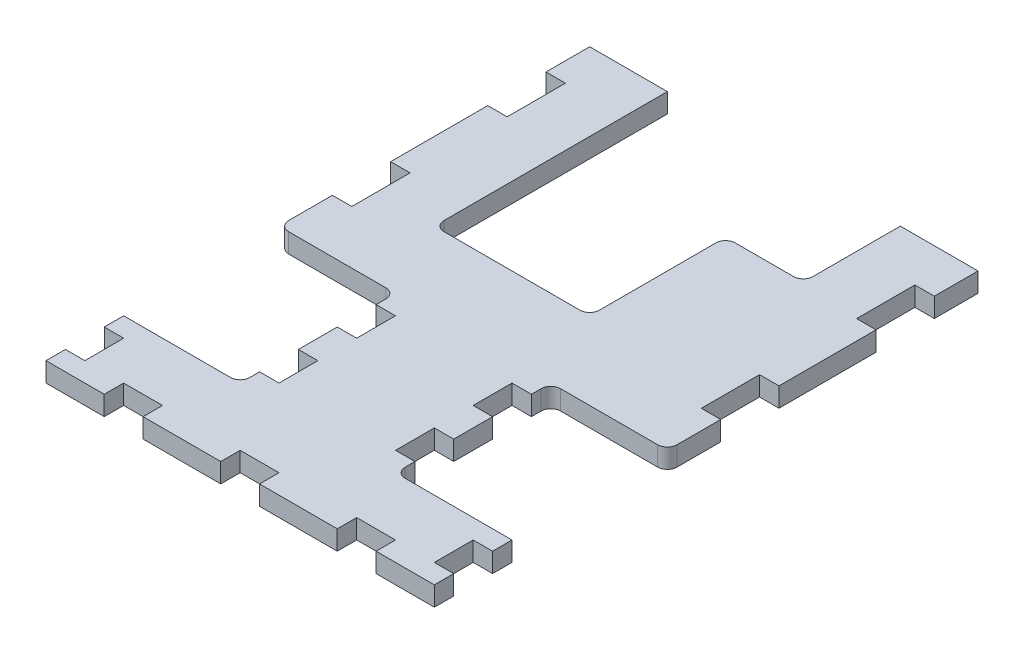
ISO-10303-21;
HEADER;
FILE_DESCRIPTION(('STEP AP214'),'2;1');
FILE_NAME('part.step','',(''),(''),'','','');
FILE_SCHEMA(('AUTOMOTIVE_DESIGN { 1 0 10303 214 1 1 1 1 }'));
ENDSEC;
DATA;
#1=APPLICATION_CONTEXT('core data for automotive mechanical design processes');
#2=APPLICATION_PROTOCOL_DEFINITION('international standard','automotive_design',2000,#1);
#3=PRODUCT_CONTEXT('',#1,'mechanical');
#4=PRODUCT('Part','Part','',(#3));
#5=PRODUCT_RELATED_PRODUCT_CATEGORY('part','',(#4));
#6=PRODUCT_DEFINITION_FORMATION('','',#4);
#7=PRODUCT_DEFINITION_CONTEXT('part definition',#1,'design');
#8=PRODUCT_DEFINITION('design','',#6,#7);
#9=PRODUCT_DEFINITION_SHAPE('','',#8);
#10=(LENGTH_UNIT() NAMED_UNIT(*) SI_UNIT(.MILLI.,.METRE.));
#11=(NAMED_UNIT(*) PLANE_ANGLE_UNIT() SI_UNIT($,.RADIAN.));
#12=(NAMED_UNIT(*) SI_UNIT($,.STERADIAN.) SOLID_ANGLE_UNIT());
#13=UNCERTAINTY_MEASURE_WITH_UNIT(LENGTH_MEASURE(1.E-05),#10,'distance_accuracy_value','');
#14=(GEOMETRIC_REPRESENTATION_CONTEXT(3) GLOBAL_UNCERTAINTY_ASSIGNED_CONTEXT((#13)) GLOBAL_UNIT_ASSIGNED_CONTEXT((#10,
#11,#12)) REPRESENTATION_CONTEXT('',''));
#15=CARTESIAN_POINT('',(0.,0.,0.));
#16=DIRECTION('',(0.,0.,1.));
#17=DIRECTION('',(1.,0.,0.));
#18=AXIS2_PLACEMENT_3D('',#15,#16,#17);
#19=CARTESIAN_POINT('',(63.5,3.175,101.6));
#20=DIRECTION('',(0.,0.,-1.));
#21=DIRECTION('',(-1.,0.,0.));
#22=AXIS2_PLACEMENT_3D('',#19,#20,#21);
#23=PLANE('',#22);
#24=DIRECTION('',(1.,0.,0.));
#25=VECTOR('',#24,1.);
#26=CARTESIAN_POINT('',(63.5,3.175,101.6));
#27=LINE('',#26,#25);
#28=CARTESIAN_POINT('',(44.45,3.175,101.6));
#29=VERTEX_POINT('',#28);
#30=CARTESIAN_POINT('',(63.5,3.175,101.6));
#31=VERTEX_POINT('',#30);
#32=EDGE_CURVE('E601',#29,#31,#27,.T.);
#33=ORIENTED_EDGE('',*,*,#32,.F.);
#34=DIRECTION('',(0.,1.,0.));
#35=VECTOR('',#34,1.);
#36=CARTESIAN_POINT('',(44.45,-23.2554631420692,101.6));
#37=LINE('',#36,#35);
#38=CARTESIAN_POINT('',(44.45,-3.175,101.6));
#39=VERTEX_POINT('',#38);
#40=EDGE_CURVE('E589',#39,#29,#37,.T.);
#41=ORIENTED_EDGE('',*,*,#40,.F.);
#42=DIRECTION('',(1.,0.,0.));
#43=VECTOR('',#42,1.);
#44=CARTESIAN_POINT('',(63.5,-3.175,101.6));
#45=LINE('',#44,#43);
#46=CARTESIAN_POINT('',(63.5,-3.175,101.6));
#47=VERTEX_POINT('',#46);
#48=EDGE_CURVE('E599',#39,#47,#45,.T.);
#49=ORIENTED_EDGE('',*,*,#48,.T.);
#50=DIRECTION('',(0.,-1.,0.));
#51=VECTOR('',#50,1.);
#52=CARTESIAN_POINT('',(63.5,3.175,101.6));
#53=LINE('',#52,#51);
#54=EDGE_CURVE('E1095',#31,#47,#53,.T.);
#55=ORIENTED_EDGE('',*,*,#54,.F.);
#56=EDGE_LOOP('',(#33,#41,#49,#55));
#57=FACE_BOUND('',#56,.T.);
#58=ADVANCED_FACE('F40',(#57),#23,.F.);
#59=CARTESIAN_POINT('',(6.35000000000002,-3.175,101.6));
#60=VERTEX_POINT('',#59);
#61=CARTESIAN_POINT('',(31.75,-3.175,101.6));
#62=VERTEX_POINT('',#61);
#63=EDGE_CURVE('E609',#60,#62,#45,.T.);
#64=ORIENTED_EDGE('',*,*,#63,.T.);
#65=DIRECTION('',(0.,1.,0.));
#66=VECTOR('',#65,1.);
#67=CARTESIAN_POINT('',(31.75,-23.2554631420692,101.6));
#68=LINE('',#67,#66);
#69=CARTESIAN_POINT('',(31.75,3.175,101.6));
#70=VERTEX_POINT('',#69);
#71=EDGE_CURVE('E56',#62,#70,#68,.T.);
#72=ORIENTED_EDGE('',*,*,#71,.T.);
#73=CARTESIAN_POINT('',(6.35000000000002,3.175,101.6));
#74=VERTEX_POINT('',#73);
#75=EDGE_CURVE('E1415',#74,#70,#27,.T.);
#76=ORIENTED_EDGE('',*,*,#75,.F.);
#77=DIRECTION('',(0.,1.,0.));
#78=VECTOR('',#77,1.);
#79=CARTESIAN_POINT('',(6.35000000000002,-23.2554631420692,101.6));
#80=LINE('',#79,#78);
#81=EDGE_CURVE('E653',#60,#74,#80,.T.);
#82=ORIENTED_EDGE('',*,*,#81,.F.);
#83=EDGE_LOOP('',(#64,#72,#76,#82));
#84=FACE_BOUND('',#83,.T.);
#85=ADVANCED_FACE('F1303',(#84),#23,.F.);
#86=CARTESIAN_POINT('',(25.4,3.175,25.4));
#87=DIRECTION('',(-1.,0.,0.));
#88=DIRECTION('',(0.,0.,1.));
#89=AXIS2_PLACEMENT_3D('',#86,#87,#88);
#90=PLANE('',#89);
#91=DIRECTION('',(0.,0.,-1.));
#92=VECTOR('',#91,1.);
#93=CARTESIAN_POINT('',(25.4,-3.175,25.4));
#94=LINE('',#93,#92);
#95=CARTESIAN_POINT('',(25.4,-3.175,73.025));
#96=VERTEX_POINT('',#95);
#97=CARTESIAN_POINT('',(25.4,-3.175,69.85));
#98=VERTEX_POINT('',#97);
#99=EDGE_CURVE('E1930',#96,#98,#94,.T.);
#100=ORIENTED_EDGE('',*,*,#99,.T.);
#101=DIRECTION('',(0.,1.,0.));
#102=VECTOR('',#101,1.);
#103=CARTESIAN_POINT('',(25.4,-23.2554631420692,69.85));
#104=LINE('',#103,#102);
#105=CARTESIAN_POINT('',(25.4,3.175,69.85));
#106=VERTEX_POINT('',#105);
#107=EDGE_CURVE('E683',#98,#106,#104,.T.);
#108=ORIENTED_EDGE('',*,*,#107,.T.);
#109=DIRECTION('',(0.,0.,-1.));
#110=VECTOR('',#109,1.);
#111=CARTESIAN_POINT('',(25.4,3.175,25.4));
#112=LINE('',#111,#110);
#113=CARTESIAN_POINT('',(25.4,3.175,73.025));
#114=VERTEX_POINT('',#113);
#115=EDGE_CURVE('E1027',#114,#106,#112,.T.);
#116=ORIENTED_EDGE('',*,*,#115,.F.);
#117=DIRECTION('',(0.,-1.,0.));
#118=VECTOR('',#117,1.);
#119=CARTESIAN_POINT('',(25.4,-3.175,73.025));
#120=LINE('',#119,#118);
#121=EDGE_CURVE('E1180',#114,#96,#120,.T.);
#122=ORIENTED_EDGE('',*,*,#121,.T.);
#123=EDGE_LOOP('',(#100,#108,#116,#122));
#124=FACE_BOUND('',#123,.T.);
#125=ADVANCED_FACE('F1308',(#124),#90,.F.);
#126=CARTESIAN_POINT('',(25.4,3.175,31.75));
#127=VERTEX_POINT('',#126);
#128=CARTESIAN_POINT('',(25.4,3.175,28.575));
#129=VERTEX_POINT('',#128);
#130=EDGE_CURVE('E1026',#127,#129,#112,.T.);
#131=ORIENTED_EDGE('',*,*,#130,.F.);
#132=DIRECTION('',(0.,1.,0.));
#133=VECTOR('',#132,1.);
#134=CARTESIAN_POINT('',(25.4,-23.2554631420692,31.75));
#135=LINE('',#134,#133);
#136=CARTESIAN_POINT('',(25.4,-3.175,31.75));
#137=VERTEX_POINT('',#136);
#138=EDGE_CURVE('E698',#137,#127,#135,.T.);
#139=ORIENTED_EDGE('',*,*,#138,.F.);
#140=CARTESIAN_POINT('',(25.4,-3.175,28.575));
#141=VERTEX_POINT('',#140);
#142=EDGE_CURVE('E1923',#137,#141,#94,.T.);
#143=ORIENTED_EDGE('',*,*,#142,.T.);
#144=DIRECTION('',(0.,-1.,0.));
#145=VECTOR('',#144,1.);
#146=CARTESIAN_POINT('',(25.4,3.175,28.575));
#147=LINE('',#146,#145);
#148=EDGE_CURVE('E1184',#141,#129,#147,.F.);
#149=ORIENTED_EDGE('',*,*,#148,.T.);
#150=EDGE_LOOP('',(#131,#139,#143,#149));
#151=FACE_BOUND('',#150,.T.);
#152=ADVANCED_FACE('F1921',(#151),#90,.F.);
#153=CARTESIAN_POINT('',(-25.4,3.175,76.2));
#154=DIRECTION('',(1.,0.,0.));
#155=DIRECTION('',(0.,0.,-1.));
#156=AXIS2_PLACEMENT_3D('',#153,#154,#155);
#157=PLANE('',#156);
#158=DIRECTION('',(0.,0.,1.));
#159=VECTOR('',#158,1.);
#160=CARTESIAN_POINT('',(-25.4,3.175,76.2));
#161=LINE('',#160,#159);
#162=CARTESIAN_POINT('',(-25.4,3.175,69.85));
#163=VERTEX_POINT('',#162);
#164=CARTESIAN_POINT('',(-25.4,3.175,73.025));
#165=VERTEX_POINT('',#164);
#166=EDGE_CURVE('E1002',#163,#165,#161,.T.);
#167=ORIENTED_EDGE('',*,*,#166,.F.);
#168=DIRECTION('',(0.,1.,0.));
#169=VECTOR('',#168,1.);
#170=CARTESIAN_POINT('',(-25.4,-23.2554631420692,69.85));
#171=LINE('',#170,#169);
#172=CARTESIAN_POINT('',(-25.4,-3.175,69.85));
#173=VERTEX_POINT('',#172);
#174=EDGE_CURVE('E758',#173,#163,#171,.T.);
#175=ORIENTED_EDGE('',*,*,#174,.F.);
#176=DIRECTION('',(0.,0.,1.));
#177=VECTOR('',#176,1.);
#178=CARTESIAN_POINT('',(-25.4,-3.175,76.2));
#179=LINE('',#178,#177);
#180=CARTESIAN_POINT('',(-25.4,-3.175,73.025));
#181=VERTEX_POINT('',#180);
#182=EDGE_CURVE('E1070',#173,#181,#179,.T.);
#183=ORIENTED_EDGE('',*,*,#182,.T.);
#184=DIRECTION('',(0.,-1.,0.));
#185=VECTOR('',#184,1.);
#186=CARTESIAN_POINT('',(-25.4,3.175,73.025));
#187=LINE('',#186,#185);
#188=EDGE_CURVE('E1196',#181,#165,#187,.F.);
#189=ORIENTED_EDGE('',*,*,#188,.T.);
#190=EDGE_LOOP('',(#167,#175,#183,#189));
#191=FACE_BOUND('',#190,.T.);
#192=ADVANCED_FACE('F1280',(#191),#157,.F.);
#193=CARTESIAN_POINT('',(-25.4,-3.175,44.45));
#194=VERTEX_POINT('',#193);
#195=CARTESIAN_POINT('',(-25.4,-3.175,57.15));
#196=VERTEX_POINT('',#195);
#197=EDGE_CURVE('E1076',#194,#196,#179,.T.);
#198=ORIENTED_EDGE('',*,*,#197,.T.);
#199=DIRECTION('',(0.,1.,0.));
#200=VECTOR('',#199,1.);
#201=CARTESIAN_POINT('',(-25.4,-23.2554631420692,57.15));
#202=LINE('',#201,#200);
#203=CARTESIAN_POINT('',(-25.4,3.175,57.15));
#204=VERTEX_POINT('',#203);
#205=EDGE_CURVE('E749',#196,#204,#202,.T.);
#206=ORIENTED_EDGE('',*,*,#205,.T.);
#207=CARTESIAN_POINT('',(-25.4,3.175,44.45));
#208=VERTEX_POINT('',#207);
#209=EDGE_CURVE('E1008',#208,#204,#161,.T.);
#210=ORIENTED_EDGE('',*,*,#209,.F.);
#211=DIRECTION('',(0.,1.,0.));
#212=VECTOR('',#211,1.);
#213=CARTESIAN_POINT('',(-25.4,-23.2554631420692,44.45));
#214=LINE('',#213,#212);
#215=EDGE_CURVE('E794',#194,#208,#214,.T.);
#216=ORIENTED_EDGE('',*,*,#215,.F.);
#217=EDGE_LOOP('',(#198,#206,#210,#216));
#218=FACE_BOUND('',#217,.T.);
#219=ADVANCED_FACE('F1271',(#218),#157,.F.);
#220=CARTESIAN_POINT('',(63.5,3.175,76.2));
#221=DIRECTION('',(-1.,0.,0.));
#222=DIRECTION('',(0.,0.,1.));
#223=AXIS2_PLACEMENT_3D('',#220,#221,#222);
#224=PLANE('',#223);
#225=DIRECTION('',(0.,0.,-1.));
#226=VECTOR('',#225,1.);
#227=CARTESIAN_POINT('',(63.5,-3.175,76.2));
#228=LINE('',#227,#226);
#229=CARTESIAN_POINT('',(63.5000000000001,-3.175,95.2499999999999));
#230=VERTEX_POINT('',#229);
#231=EDGE_CURVE('E608',#47,#230,#228,.T.);
#232=ORIENTED_EDGE('',*,*,#231,.T.);
#233=DIRECTION('',(0.,1.,0.));
#234=VECTOR('',#233,1.);
#235=CARTESIAN_POINT('',(63.5000000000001,-23.2554631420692,95.2499999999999));
#236=LINE('',#235,#234);
#237=CARTESIAN_POINT('',(63.5000000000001,3.175,95.2499999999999));
#238=VERTEX_POINT('',#237);
#239=EDGE_CURVE('E820',#230,#238,#236,.T.);
#240=ORIENTED_EDGE('',*,*,#239,.T.);
#241=DIRECTION('',(0.,0.,-1.));
#242=VECTOR('',#241,1.);
#243=CARTESIAN_POINT('',(63.5,3.175,76.2));
#244=LINE('',#243,#242);
#245=EDGE_CURVE('E1020',#31,#238,#244,.T.);
#246=ORIENTED_EDGE('',*,*,#245,.F.);
#247=ORIENTED_EDGE('',*,*,#54,.T.);
#248=EDGE_LOOP('',(#232,#240,#246,#247));
#249=FACE_BOUND('',#248,.T.);
#250=ADVANCED_FACE('F1320',(#249),#224,.F.);
#251=CARTESIAN_POINT('',(63.5,3.175,-76.2));
#252=DIRECTION('',(-1.,0.,0.));
#253=DIRECTION('',(0.,0.,1.));
#254=AXIS2_PLACEMENT_3D('',#251,#252,#253);
#255=PLANE('',#254);
#256=DIRECTION('',(0.,0.,-1.));
#257=VECTOR('',#256,1.);
#258=CARTESIAN_POINT('',(63.5,-3.175,-76.2));
#259=LINE('',#258,#257);
#260=CARTESIAN_POINT('',(63.5,-3.175,22.225));
#261=VERTEX_POINT('',#260);
#262=CARTESIAN_POINT('',(63.5,-3.175,7.93749999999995));
#263=VERTEX_POINT('',#262);
#264=EDGE_CURVE('E1934',#261,#263,#259,.T.);
#265=ORIENTED_EDGE('',*,*,#264,.T.);
#266=DIRECTION('',(0.,1.,0.));
#267=VECTOR('',#266,1.);
#268=CARTESIAN_POINT('',(63.5,-23.2554631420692,7.93749999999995));
#269=LINE('',#268,#267);
#270=CARTESIAN_POINT('',(63.5,3.175,7.93749999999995));
#271=VERTEX_POINT('',#270);
#272=EDGE_CURVE('E850',#263,#271,#269,.T.);
#273=ORIENTED_EDGE('',*,*,#272,.T.);
#274=DIRECTION('',(0.,0.,-1.));
#275=VECTOR('',#274,1.);
#276=CARTESIAN_POINT('',(63.5,3.175,-76.2));
#277=LINE('',#276,#275);
#278=CARTESIAN_POINT('',(63.5,3.175,22.225));
#279=VERTEX_POINT('',#278);
#280=EDGE_CURVE('E1035',#279,#271,#277,.T.);
#281=ORIENTED_EDGE('',*,*,#280,.F.);
#282=DIRECTION('',(0.,-1.,0.));
#283=VECTOR('',#282,1.);
#284=CARTESIAN_POINT('',(63.5,3.175,22.225));
#285=LINE('',#284,#283);
#286=EDGE_CURVE('E1172',#279,#261,#285,.T.);
#287=ORIENTED_EDGE('',*,*,#286,.T.);
#288=EDGE_LOOP('',(#265,#273,#281,#287));
#289=FACE_BOUND('',#288,.T.);
#290=ADVANCED_FACE('F1328',(#289),#255,.F.);
#291=CARTESIAN_POINT('',(63.5,3.175,-61.9125));
#292=VERTEX_POINT('',#291);
#293=CARTESIAN_POINT('',(63.5,3.175,-76.2));
#294=VERTEX_POINT('',#293);
#295=EDGE_CURVE('E1034',#292,#294,#277,.T.);
#296=ORIENTED_EDGE('',*,*,#295,.F.);
#297=DIRECTION('',(0.,1.,0.));
#298=VECTOR('',#297,1.);
#299=CARTESIAN_POINT('',(63.5,-23.2554631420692,-61.9125));
#300=LINE('',#299,#298);
#301=CARTESIAN_POINT('',(63.5,-3.175,-61.9125));
#302=VERTEX_POINT('',#301);
#303=EDGE_CURVE('E861',#302,#292,#300,.T.);
#304=ORIENTED_EDGE('',*,*,#303,.F.);
#305=CARTESIAN_POINT('',(63.5,-3.175,-76.2));
#306=VERTEX_POINT('',#305);
#307=EDGE_CURVE('E1366',#302,#306,#259,.T.);
#308=ORIENTED_EDGE('',*,*,#307,.T.);
#309=DIRECTION('',(0.,-1.,0.));
#310=VECTOR('',#309,1.);
#311=CARTESIAN_POINT('',(63.5,3.175,-76.2));
#312=LINE('',#311,#310);
#313=EDGE_CURVE('E1364',#294,#306,#312,.T.);
#314=ORIENTED_EDGE('',*,*,#313,.F.);
#315=EDGE_LOOP('',(#296,#304,#308,#314));
#316=FACE_BOUND('',#315,.T.);
#317=ADVANCED_FACE('F1322',(#316),#255,.F.);
#318=CARTESIAN_POINT('',(-31.75,-3.175,101.6));
#319=VERTEX_POINT('',#318);
#320=CARTESIAN_POINT('',(-6.34999999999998,-3.175,101.6));
#321=VERTEX_POINT('',#320);
#322=EDGE_CURVE('E614',#319,#321,#45,.T.);
#323=ORIENTED_EDGE('',*,*,#322,.T.);
#324=DIRECTION('',(0.,1.,0.));
#325=VECTOR('',#324,1.);
#326=CARTESIAN_POINT('',(-6.34999999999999,-23.2554631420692,101.6));
#327=LINE('',#326,#325);
#328=CARTESIAN_POINT('',(-6.34999999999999,3.175,101.6));
#329=VERTEX_POINT('',#328);
#330=EDGE_CURVE('E64',#321,#329,#327,.T.);
#331=ORIENTED_EDGE('',*,*,#330,.T.);
#332=CARTESIAN_POINT('',(-31.75,3.175,101.6));
#333=VERTEX_POINT('',#332);
#334=EDGE_CURVE('E1019',#333,#329,#27,.T.);
#335=ORIENTED_EDGE('',*,*,#334,.F.);
#336=DIRECTION('',(0.,1.,0.));
#337=VECTOR('',#336,1.);
#338=CARTESIAN_POINT('',(-31.75,-23.2554631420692,101.6));
#339=LINE('',#338,#337);
#340=EDGE_CURVE('E632',#319,#333,#339,.T.);
#341=ORIENTED_EDGE('',*,*,#340,.F.);
#342=EDGE_LOOP('',(#323,#331,#335,#341));
#343=FACE_BOUND('',#342,.T.);
#344=ADVANCED_FACE('F629',(#343),#23,.F.);
#345=CARTESIAN_POINT('',(-63.5,3.175,101.6));
#346=DIRECTION('',(1.,0.,0.));
#347=DIRECTION('',(0.,0.,-1.));
#348=AXIS2_PLACEMENT_3D('',#345,#346,#347);
#349=PLANE('',#348);
#350=DIRECTION('',(0.,0.,1.));
#351=VECTOR('',#350,1.);
#352=CARTESIAN_POINT('',(-63.5,3.175,101.6));
#353=LINE('',#352,#351);
#354=CARTESIAN_POINT('',(-63.5,3.175,95.25));
#355=VERTEX_POINT('',#354);
#356=CARTESIAN_POINT('',(-63.5,3.175,101.6));
#357=VERTEX_POINT('',#356);
#358=EDGE_CURVE('E1011',#355,#357,#353,.T.);
#359=ORIENTED_EDGE('',*,*,#358,.F.);
#360=DIRECTION('',(0.,1.,0.));
#361=VECTOR('',#360,1.);
#362=CARTESIAN_POINT('',(-63.5,-23.2554631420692,95.25));
#363=LINE('',#362,#361);
#364=CARTESIAN_POINT('',(-63.5,-3.175,95.25));
#365=VERTEX_POINT('',#364);
#366=EDGE_CURVE('E932',#365,#355,#363,.T.);
#367=ORIENTED_EDGE('',*,*,#366,.F.);
#368=DIRECTION('',(0.,0.,1.));
#369=VECTOR('',#368,1.);
#370=CARTESIAN_POINT('',(-63.5,-3.175,101.6));
#371=LINE('',#370,#369);
#372=CARTESIAN_POINT('',(-63.5,-3.175,101.6));
#373=VERTEX_POINT('',#372);
#374=EDGE_CURVE('E616',#365,#373,#371,.T.);
#375=ORIENTED_EDGE('',*,*,#374,.T.);
#376=DIRECTION('',(0.,-1.,0.));
#377=VECTOR('',#376,1.);
#378=CARTESIAN_POINT('',(-63.5,3.175,101.6));
#379=LINE('',#378,#377);
#380=EDGE_CURVE('E1091',#357,#373,#379,.T.);
#381=ORIENTED_EDGE('',*,*,#380,.F.);
#382=EDGE_LOOP('',(#359,#367,#375,#381));
#383=FACE_BOUND('',#382,.T.);
#384=ADVANCED_FACE('F1090',(#383),#349,.F.);
#385=CARTESIAN_POINT('',(-63.5,3.175,25.4));
#386=DIRECTION('',(1.,0.,0.));
#387=DIRECTION('',(0.,0.,-1.));
#388=AXIS2_PLACEMENT_3D('',#385,#386,#387);
#389=PLANE('',#388);
#390=DIRECTION('',(0.,0.,1.));
#391=VECTOR('',#390,1.);
#392=CARTESIAN_POINT('',(-63.5,3.175,25.4));
#393=LINE('',#392,#391);
#394=CARTESIAN_POINT('',(-63.5,3.175,7.9375));
#395=VERTEX_POINT('',#394);
#396=CARTESIAN_POINT('',(-63.5,3.175,22.225));
#397=VERTEX_POINT('',#396);
#398=EDGE_CURVE('E992',#395,#397,#393,.T.);
#399=ORIENTED_EDGE('',*,*,#398,.F.);
#400=DIRECTION('',(0.,1.,0.));
#401=VECTOR('',#400,1.);
#402=CARTESIAN_POINT('',(-63.5,-23.2554631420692,7.9375));
#403=LINE('',#402,#401);
#404=CARTESIAN_POINT('',(-63.5,-3.175,7.9375));
#405=VERTEX_POINT('',#404);
#406=EDGE_CURVE('E958',#405,#395,#403,.T.);
#407=ORIENTED_EDGE('',*,*,#406,.F.);
#408=DIRECTION('',(0.,0.,1.));
#409=VECTOR('',#408,1.);
#410=CARTESIAN_POINT('',(-63.5,-3.175,25.4));
#411=LINE('',#410,#409);
#412=CARTESIAN_POINT('',(-63.5,-3.175,22.225));
#413=VERTEX_POINT('',#412);
#414=EDGE_CURVE('E1061',#405,#413,#411,.T.);
#415=ORIENTED_EDGE('',*,*,#414,.T.);
#416=DIRECTION('',(0.,-1.,0.));
#417=VECTOR('',#416,1.);
#418=CARTESIAN_POINT('',(-63.5,3.175,22.225));
#419=LINE('',#418,#417);
#420=EDGE_CURVE('E1205',#413,#397,#419,.F.);
#421=ORIENTED_EDGE('',*,*,#420,.T.);
#422=EDGE_LOOP('',(#399,#407,#415,#421));
#423=FACE_BOUND('',#422,.T.);
#424=ADVANCED_FACE('F1327',(#423),#389,.F.);
#425=CARTESIAN_POINT('',(-63.5,-3.175,-42.8625));
#426=VERTEX_POINT('',#425);
#427=CARTESIAN_POINT('',(-63.5,-3.175,-11.1125));
#428=VERTEX_POINT('',#427);
#429=EDGE_CURVE('E1066',#426,#428,#411,.T.);
#430=ORIENTED_EDGE('',*,*,#429,.T.);
#431=DIRECTION('',(0.,1.,0.));
#432=VECTOR('',#431,1.);
#433=CARTESIAN_POINT('',(-63.5,-23.2554631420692,-11.1125));
#434=LINE('',#433,#432);
#435=CARTESIAN_POINT('',(-63.5,3.175,-11.1125));
#436=VERTEX_POINT('',#435);
#437=EDGE_CURVE('E951',#428,#436,#434,.T.);
#438=ORIENTED_EDGE('',*,*,#437,.T.);
#439=CARTESIAN_POINT('',(-63.5,3.175,-42.8625));
#440=VERTEX_POINT('',#439);
#441=EDGE_CURVE('E998',#440,#436,#393,.T.);
#442=ORIENTED_EDGE('',*,*,#441,.F.);
#443=DIRECTION('',(0.,1.,0.));
#444=VECTOR('',#443,1.);
#445=CARTESIAN_POINT('',(-63.5,-23.2554631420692,-42.8625));
#446=LINE('',#445,#444);
#447=EDGE_CURVE('E984',#426,#440,#446,.T.);
#448=ORIENTED_EDGE('',*,*,#447,.F.);
#449=EDGE_LOOP('',(#430,#438,#442,#448));
#450=FACE_BOUND('',#449,.T.);
#451=ADVANCED_FACE('F2000',(#450),#389,.F.);
#452=CARTESIAN_POINT('',(-63.5,3.175,-76.2));
#453=DIRECTION('',(0.,0.,1.));
#454=DIRECTION('',(1.,0.,0.));
#455=AXIS2_PLACEMENT_3D('',#452,#453,#454);
#456=PLANE('',#455);
#457=DIRECTION('',(-1.,0.,0.));
#458=VECTOR('',#457,1.);
#459=CARTESIAN_POINT('',(-63.5,-3.175,-76.2));
#460=LINE('',#459,#458);
#461=CARTESIAN_POINT('',(-38.1,-3.175,-76.2));
#462=VERTEX_POINT('',#461);
#463=CARTESIAN_POINT('',(-63.5,-3.175,-76.2));
#464=VERTEX_POINT('',#463);
#465=EDGE_CURVE('E988',#462,#464,#460,.T.);
#466=ORIENTED_EDGE('',*,*,#465,.T.);
#467=DIRECTION('',(0.,-1.,0.));
#468=VECTOR('',#467,1.);
#469=CARTESIAN_POINT('',(-63.5,3.175,-76.2));
#470=LINE('',#469,#468);
#471=CARTESIAN_POINT('',(-63.5,3.175,-76.2));
#472=VERTEX_POINT('',#471);
#473=EDGE_CURVE('E1129',#472,#464,#470,.T.);
#474=ORIENTED_EDGE('',*,*,#473,.F.);
#475=DIRECTION('',(-1.,0.,0.));
#476=VECTOR('',#475,1.);
#477=CARTESIAN_POINT('',(-63.5,3.175,-76.2));
#478=LINE('',#477,#476);
#479=CARTESIAN_POINT('',(-38.1,3.175,-76.2));
#480=VERTEX_POINT('',#479);
#481=EDGE_CURVE('E989',#480,#472,#478,.T.);
#482=ORIENTED_EDGE('',*,*,#481,.F.);
#483=DIRECTION('',(0.,-1.,0.));
#484=VECTOR('',#483,1.);
#485=CARTESIAN_POINT('',(-38.1,3.175,-76.2));
#486=LINE('',#485,#484);
#487=EDGE_CURVE('E1058',#480,#462,#486,.T.);
#488=ORIENTED_EDGE('',*,*,#487,.T.);
#489=EDGE_LOOP('',(#466,#474,#482,#488));
#490=FACE_BOUND('',#489,.T.);
#491=ADVANCED_FACE('F1997',(#490),#456,.F.);
#492=CARTESIAN_POINT('',(-63.5,-3.175,-61.9125));
#493=VERTEX_POINT('',#492);
#494=EDGE_CURVE('E1062',#464,#493,#411,.T.);
#495=ORIENTED_EDGE('',*,*,#494,.T.);
#496=DIRECTION('',(0.,1.,0.));
#497=VECTOR('',#496,1.);
#498=CARTESIAN_POINT('',(-63.5,-23.2554631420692,-61.9125));
#499=LINE('',#498,#497);
#500=CARTESIAN_POINT('',(-63.5,3.175,-61.9125));
#501=VERTEX_POINT('',#500);
#502=EDGE_CURVE('E977',#493,#501,#499,.T.);
#503=ORIENTED_EDGE('',*,*,#502,.T.);
#504=EDGE_CURVE('E994',#472,#501,#393,.T.);
#505=ORIENTED_EDGE('',*,*,#504,.F.);
#506=ORIENTED_EDGE('',*,*,#473,.T.);
#507=EDGE_LOOP('',(#495,#503,#505,#506));
#508=FACE_BOUND('',#507,.T.);
#509=ADVANCED_FACE('F1993',(#508),#389,.F.);
#510=CARTESIAN_POINT('',(-25.4,3.175,25.4));
#511=DIRECTION('',(0.,0.,-1.));
#512=DIRECTION('',(-1.,0.,0.));
#513=AXIS2_PLACEMENT_3D('',#510,#511,#512);
#514=PLANE('',#513);
#515=DIRECTION('',(1.,0.,0.));
#516=VECTOR('',#515,1.);
#517=CARTESIAN_POINT('',(-25.4,-3.175,25.4));
#518=LINE('',#517,#516);
#519=CARTESIAN_POINT('',(-60.325,-3.175,25.4));
#520=VERTEX_POINT('',#519);
#521=CARTESIAN_POINT('',(-28.575,-3.175,25.4));
#522=VERTEX_POINT('',#521);
#523=EDGE_CURVE('E1065',#520,#522,#518,.T.);
#524=ORIENTED_EDGE('',*,*,#523,.T.);
#525=DIRECTION('',(0.,-1.,0.));
#526=VECTOR('',#525,1.);
#527=CARTESIAN_POINT('',(-28.575,3.175,25.4));
#528=LINE('',#527,#526);
#529=CARTESIAN_POINT('',(-28.575,3.175,25.4));
#530=VERTEX_POINT('',#529);
#531=EDGE_CURVE('E1202',#522,#530,#528,.F.);
#532=ORIENTED_EDGE('',*,*,#531,.T.);
#533=DIRECTION('',(1.,0.,0.));
#534=VECTOR('',#533,1.);
#535=CARTESIAN_POINT('',(-25.4,3.175,25.4));
#536=LINE('',#535,#534);
#537=CARTESIAN_POINT('',(-60.325,3.175,25.4));
#538=VERTEX_POINT('',#537);
#539=EDGE_CURVE('E997',#538,#530,#536,.T.);
#540=ORIENTED_EDGE('',*,*,#539,.F.);
#541=DIRECTION('',(0.,-1.,0.));
#542=VECTOR('',#541,1.);
#543=CARTESIAN_POINT('',(-60.325,3.175,25.4));
#544=LINE('',#543,#542);
#545=EDGE_CURVE('E1199',#538,#520,#544,.T.);
#546=ORIENTED_EDGE('',*,*,#545,.T.);
#547=EDGE_LOOP('',(#524,#532,#540,#546));
#548=FACE_BOUND('',#547,.T.);
#549=ADVANCED_FACE('F1245',(#548),#514,.F.);
#550=CARTESIAN_POINT('',(-25.4,-3.175,28.575));
#551=VERTEX_POINT('',#550);
#552=CARTESIAN_POINT('',(-25.4,-3.175,31.75));
#553=VERTEX_POINT('',#552);
#554=EDGE_CURVE('E1071',#551,#553,#179,.T.);
#555=ORIENTED_EDGE('',*,*,#554,.T.);
#556=DIRECTION('',(0.,1.,0.));
#557=VECTOR('',#556,1.);
#558=CARTESIAN_POINT('',(-25.4,-23.2554631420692,31.75));
#559=LINE('',#558,#557);
#560=CARTESIAN_POINT('',(-25.4,3.175,31.75));
#561=VERTEX_POINT('',#560);
#562=EDGE_CURVE('E785',#553,#561,#559,.T.);
#563=ORIENTED_EDGE('',*,*,#562,.T.);
#564=CARTESIAN_POINT('',(-25.4,3.175,28.575));
#565=VERTEX_POINT('',#564);
#566=EDGE_CURVE('E1003',#565,#561,#161,.T.);
#567=ORIENTED_EDGE('',*,*,#566,.F.);
#568=DIRECTION('',(0.,-1.,0.));
#569=VECTOR('',#568,1.);
#570=CARTESIAN_POINT('',(-25.4,-3.175,28.575));
#571=LINE('',#570,#569);
#572=EDGE_CURVE('E1192',#565,#551,#571,.T.);
#573=ORIENTED_EDGE('',*,*,#572,.T.);
#574=EDGE_LOOP('',(#555,#563,#567,#573));
#575=FACE_BOUND('',#574,.T.);
#576=ADVANCED_FACE('F1253',(#575),#157,.F.);
#577=CARTESIAN_POINT('',(-63.5,3.175,76.2));
#578=DIRECTION('',(0.,0.,1.));
#579=DIRECTION('',(1.,0.,0.));
#580=AXIS2_PLACEMENT_3D('',#577,#578,#579);
#581=PLANE('',#580);
#582=DIRECTION('',(-1.,0.,0.));
#583=VECTOR('',#582,1.);
#584=CARTESIAN_POINT('',(-63.5,3.175,76.2));
#585=LINE('',#584,#583);
#586=CARTESIAN_POINT('',(-28.575,3.175,76.2));
#587=VERTEX_POINT('',#586);
#588=CARTESIAN_POINT('',(-63.5,3.175,76.2));
#589=VERTEX_POINT('',#588);
#590=EDGE_CURVE('E1007',#587,#589,#585,.T.);
#591=ORIENTED_EDGE('',*,*,#590,.F.);
#592=DIRECTION('',(0.,-1.,0.));
#593=VECTOR('',#592,1.);
#594=CARTESIAN_POINT('',(-28.575,-3.175,76.2));
#595=LINE('',#594,#593);
#596=CARTESIAN_POINT('',(-28.575,-3.175,76.2));
#597=VERTEX_POINT('',#596);
#598=EDGE_CURVE('E1189',#587,#597,#595,.T.);
#599=ORIENTED_EDGE('',*,*,#598,.T.);
#600=DIRECTION('',(-1.,0.,0.));
#601=VECTOR('',#600,1.);
#602=CARTESIAN_POINT('',(-63.5,-3.175,76.2));
#603=LINE('',#602,#601);
#604=CARTESIAN_POINT('',(-63.5,-3.175,76.2));
#605=VERTEX_POINT('',#604);
#606=EDGE_CURVE('E1075',#597,#605,#603,.T.);
#607=ORIENTED_EDGE('',*,*,#606,.T.);
#608=DIRECTION('',(0.,-1.,0.));
#609=VECTOR('',#608,1.);
#610=CARTESIAN_POINT('',(-63.5,3.175,76.2));
#611=LINE('',#610,#609);
#612=EDGE_CURVE('E1094',#589,#605,#611,.T.);
#613=ORIENTED_EDGE('',*,*,#612,.F.);
#614=EDGE_LOOP('',(#591,#599,#607,#613));
#615=FACE_BOUND('',#614,.T.);
#616=ADVANCED_FACE('F1128',(#615),#581,.F.);
#617=CARTESIAN_POINT('',(-63.5,-3.175,82.55));
#618=VERTEX_POINT('',#617);
#619=EDGE_CURVE('E610',#605,#618,#371,.T.);
#620=ORIENTED_EDGE('',*,*,#619,.T.);
#621=DIRECTION('',(0.,1.,0.));
#622=VECTOR('',#621,1.);
#623=CARTESIAN_POINT('',(-63.5,-23.2554631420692,82.55));
#624=LINE('',#623,#622);
#625=CARTESIAN_POINT('',(-63.5,3.175,82.55));
#626=VERTEX_POINT('',#625);
#627=EDGE_CURVE('E925',#618,#626,#624,.T.);
#628=ORIENTED_EDGE('',*,*,#627,.T.);
#629=EDGE_CURVE('E1012',#589,#626,#353,.T.);
#630=ORIENTED_EDGE('',*,*,#629,.F.);
#631=ORIENTED_EDGE('',*,*,#612,.T.);
#632=EDGE_LOOP('',(#620,#628,#630,#631));
#633=FACE_BOUND('',#632,.T.);
#634=ADVANCED_FACE('F1123',(#633),#349,.F.);
#635=CARTESIAN_POINT('',(-44.45,-3.175,101.6));
#636=VERTEX_POINT('',#635);
#637=EDGE_CURVE('E612',#373,#636,#45,.T.);
#638=ORIENTED_EDGE('',*,*,#637,.T.);
#639=DIRECTION('',(0.,1.,0.));
#640=VECTOR('',#639,1.);
#641=CARTESIAN_POINT('',(-44.45,-23.2554631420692,101.6));
#642=LINE('',#641,#640);
#643=CARTESIAN_POINT('',(-44.45,3.175,101.6));
#644=VERTEX_POINT('',#643);
#645=EDGE_CURVE('E898',#636,#644,#642,.T.);
#646=ORIENTED_EDGE('',*,*,#645,.T.);
#647=EDGE_CURVE('E1015',#357,#644,#27,.T.);
#648=ORIENTED_EDGE('',*,*,#647,.F.);
#649=ORIENTED_EDGE('',*,*,#380,.T.);
#650=EDGE_LOOP('',(#638,#646,#648,#649));
#651=FACE_BOUND('',#650,.T.);
#652=ADVANCED_FACE('F1093',(#651),#23,.F.);
#653=CARTESIAN_POINT('',(63.5000000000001,3.175,82.5499999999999));
#654=VERTEX_POINT('',#653);
#655=CARTESIAN_POINT('',(63.5,3.175,76.2));
#656=VERTEX_POINT('',#655);
#657=EDGE_CURVE('E1018',#654,#656,#244,.T.);
#658=ORIENTED_EDGE('',*,*,#657,.F.);
#659=DIRECTION('',(0.,1.,0.));
#660=VECTOR('',#659,1.);
#661=CARTESIAN_POINT('',(63.5000000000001,-23.2554631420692,82.5499999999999));
#662=LINE('',#661,#660);
#663=CARTESIAN_POINT('',(63.5000000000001,-3.175,82.5499999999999));
#664=VERTEX_POINT('',#663);
#665=EDGE_CURVE('E817',#664,#654,#662,.T.);
#666=ORIENTED_EDGE('',*,*,#665,.F.);
#667=CARTESIAN_POINT('',(63.5,-3.175,76.2));
#668=VERTEX_POINT('',#667);
#669=EDGE_CURVE('E620',#664,#668,#228,.T.);
#670=ORIENTED_EDGE('',*,*,#669,.T.);
#671=DIRECTION('',(0.,-1.,0.));
#672=VECTOR('',#671,1.);
#673=CARTESIAN_POINT('',(63.5,3.175,76.2));
#674=LINE('',#673,#672);
#675=EDGE_CURVE('E1368',#656,#668,#674,.T.);
#676=ORIENTED_EDGE('',*,*,#675,.F.);
#677=EDGE_LOOP('',(#658,#666,#670,#676));
#678=FACE_BOUND('',#677,.T.);
#679=ADVANCED_FACE('F1313',(#678),#224,.F.);
#680=CARTESIAN_POINT('',(25.4,3.175,76.2));
#681=DIRECTION('',(0.,0.,1.));
#682=DIRECTION('',(1.,0.,0.));
#683=AXIS2_PLACEMENT_3D('',#680,#681,#682);
#684=PLANE('',#683);
#685=DIRECTION('',(-1.,0.,0.));
#686=VECTOR('',#685,1.);
#687=CARTESIAN_POINT('',(25.4,-3.175,76.2));
#688=LINE('',#687,#686);
#689=CARTESIAN_POINT('',(28.575,-3.175,76.2));
#690=VERTEX_POINT('',#689);
#691=EDGE_CURVE('E1950',#668,#690,#688,.T.);
#692=ORIENTED_EDGE('',*,*,#691,.T.);
#693=DIRECTION('',(0.,-1.,0.));
#694=VECTOR('',#693,1.);
#695=CARTESIAN_POINT('',(28.575,3.175,76.2));
#696=LINE('',#695,#694);
#697=CARTESIAN_POINT('',(28.575,3.175,76.2));
#698=VERTEX_POINT('',#697);
#699=EDGE_CURVE('E1187',#690,#698,#696,.F.);
#700=ORIENTED_EDGE('',*,*,#699,.T.);
#701=DIRECTION('',(-1.,0.,0.));
#702=VECTOR('',#701,1.);
#703=CARTESIAN_POINT('',(25.4,3.175,76.2));
#704=LINE('',#703,#702);
#705=EDGE_CURVE('E1023',#656,#698,#704,.T.);
#706=ORIENTED_EDGE('',*,*,#705,.F.);
#707=ORIENTED_EDGE('',*,*,#675,.T.);
#708=EDGE_LOOP('',(#692,#700,#706,#707));
#709=FACE_BOUND('',#708,.T.);
#710=ADVANCED_FACE('F1318',(#709),#684,.F.);
#711=CARTESIAN_POINT('',(25.4,3.175,57.15));
#712=VERTEX_POINT('',#711);
#713=CARTESIAN_POINT('',(25.4,3.175,44.45));
#714=VERTEX_POINT('',#713);
#715=EDGE_CURVE('E1031',#712,#714,#112,.T.);
#716=ORIENTED_EDGE('',*,*,#715,.F.);
#717=DIRECTION('',(0.,1.,0.));
#718=VECTOR('',#717,1.);
#719=CARTESIAN_POINT('',(25.4,-23.2554631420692,57.15));
#720=LINE('',#719,#718);
#721=CARTESIAN_POINT('',(25.4,-3.175,57.15));
#722=VERTEX_POINT('',#721);
#723=EDGE_CURVE('E678',#722,#712,#720,.T.);
#724=ORIENTED_EDGE('',*,*,#723,.F.);
#725=CARTESIAN_POINT('',(25.4,-3.175,44.45));
#726=VERTEX_POINT('',#725);
#727=EDGE_CURVE('E1937',#722,#726,#94,.T.);
#728=ORIENTED_EDGE('',*,*,#727,.T.);
#729=DIRECTION('',(0.,1.,0.));
#730=VECTOR('',#729,1.);
#731=CARTESIAN_POINT('',(25.4,-23.2554631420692,44.45));
#732=LINE('',#731,#730);
#733=EDGE_CURVE('E710',#726,#714,#732,.T.);
#734=ORIENTED_EDGE('',*,*,#733,.T.);
#735=EDGE_LOOP('',(#716,#724,#728,#734));
#736=FACE_BOUND('',#735,.T.);
#737=ADVANCED_FACE('F1349',(#736),#90,.F.);
#738=CARTESIAN_POINT('',(63.5,3.175,25.4));
#739=DIRECTION('',(0.,0.,-1.));
#740=DIRECTION('',(-1.,0.,0.));
#741=AXIS2_PLACEMENT_3D('',#738,#739,#740);
#742=PLANE('',#741);
#743=DIRECTION('',(1.,0.,0.));
#744=VECTOR('',#743,1.);
#745=CARTESIAN_POINT('',(63.5,-3.175,25.4));
#746=LINE('',#745,#744);
#747=CARTESIAN_POINT('',(28.575,-3.175,25.4));
#748=VERTEX_POINT('',#747);
#749=CARTESIAN_POINT('',(60.325,-3.175,25.4));
#750=VERTEX_POINT('',#749);
#751=EDGE_CURVE('E1927',#748,#750,#746,.T.);
#752=ORIENTED_EDGE('',*,*,#751,.T.);
#753=DIRECTION('',(0.,-1.,0.));
#754=VECTOR('',#753,1.);
#755=CARTESIAN_POINT('',(60.325,3.175,25.4));
#756=LINE('',#755,#754);
#757=CARTESIAN_POINT('',(60.325,3.175,25.4));
#758=VERTEX_POINT('',#757);
#759=EDGE_CURVE('E1178',#750,#758,#756,.F.);
#760=ORIENTED_EDGE('',*,*,#759,.T.);
#761=DIRECTION('',(1.,0.,0.));
#762=VECTOR('',#761,1.);
#763=CARTESIAN_POINT('',(63.5,3.175,25.4));
#764=LINE('',#763,#762);
#765=CARTESIAN_POINT('',(28.575,3.175,25.4));
#766=VERTEX_POINT('',#765);
#767=EDGE_CURVE('E1030',#766,#758,#764,.T.);
#768=ORIENTED_EDGE('',*,*,#767,.F.);
#769=DIRECTION('',(0.,-1.,0.));
#770=VECTOR('',#769,1.);
#771=CARTESIAN_POINT('',(28.575,-3.175,25.4));
#772=LINE('',#771,#770);
#773=EDGE_CURVE('E1175',#766,#748,#772,.T.);
#774=ORIENTED_EDGE('',*,*,#773,.T.);
#775=EDGE_LOOP('',(#752,#760,#768,#774));
#776=FACE_BOUND('',#775,.T.);
#777=ADVANCED_FACE('F1341',(#776),#742,.F.);
#778=CARTESIAN_POINT('',(63.5,3.175,-11.1125));
#779=VERTEX_POINT('',#778);
#780=CARTESIAN_POINT('',(63.5,3.175,-42.8625));
#781=VERTEX_POINT('',#780);
#782=EDGE_CURVE('E1039',#779,#781,#277,.T.);
#783=ORIENTED_EDGE('',*,*,#782,.F.);
#784=DIRECTION('',(0.,1.,0.));
#785=VECTOR('',#784,1.);
#786=CARTESIAN_POINT('',(63.5,-23.2554631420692,-11.1125));
#787=LINE('',#786,#785);
#788=CARTESIAN_POINT('',(63.5,-3.175,-11.1125));
#789=VERTEX_POINT('',#788);
#790=EDGE_CURVE('E845',#789,#779,#787,.T.);
#791=ORIENTED_EDGE('',*,*,#790,.F.);
#792=CARTESIAN_POINT('',(63.5,-3.175,-42.8625));
#793=VERTEX_POINT('',#792);
#794=EDGE_CURVE('E1932',#789,#793,#259,.T.);
#795=ORIENTED_EDGE('',*,*,#794,.T.);
#796=DIRECTION('',(0.,1.,0.));
#797=VECTOR('',#796,1.);
#798=CARTESIAN_POINT('',(63.5,-23.2554631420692,-42.8625));
#799=LINE('',#798,#797);
#800=EDGE_CURVE('E870',#793,#781,#799,.T.);
#801=ORIENTED_EDGE('',*,*,#800,.T.);
#802=EDGE_LOOP('',(#783,#791,#795,#801));
#803=FACE_BOUND('',#802,.T.);
#804=ADVANCED_FACE('F1331',(#803),#255,.F.);
#805=CARTESIAN_POINT('',(38.1,3.175,-76.2));
#806=DIRECTION('',(0.,0.,1.));
#807=DIRECTION('',(1.,0.,0.));
#808=AXIS2_PLACEMENT_3D('',#805,#806,#807);
#809=PLANE('',#808);
#810=DIRECTION('',(-1.,0.,0.));
#811=VECTOR('',#810,1.);
#812=CARTESIAN_POINT('',(38.1,-3.175,-76.2));
#813=LINE('',#812,#811);
#814=CARTESIAN_POINT('',(38.1,-3.175,-76.2));
#815=VERTEX_POINT('',#814);
#816=EDGE_CURVE('E1373',#306,#815,#813,.T.);
#817=ORIENTED_EDGE('',*,*,#816,.T.);
#818=DIRECTION('',(0.,-1.,0.));
#819=VECTOR('',#818,1.);
#820=CARTESIAN_POINT('',(38.1,3.175,-76.2));
#821=LINE('',#820,#819);
#822=CARTESIAN_POINT('',(38.1,3.175,-76.2));
#823=VERTEX_POINT('',#822);
#824=EDGE_CURVE('E1369',#823,#815,#821,.T.);
#825=ORIENTED_EDGE('',*,*,#824,.F.);
#826=DIRECTION('',(-1.,0.,0.));
#827=VECTOR('',#826,1.);
#828=CARTESIAN_POINT('',(38.1,3.175,-76.2));
#829=LINE('',#828,#827);
#830=EDGE_CURVE('E1038',#294,#823,#829,.T.);
#831=ORIENTED_EDGE('',*,*,#830,.F.);
#832=ORIENTED_EDGE('',*,*,#313,.T.);
#833=EDGE_LOOP('',(#817,#825,#831,#832));
#834=FACE_BOUND('',#833,.T.);
#835=ADVANCED_FACE('F1340',(#834),#809,.F.);
#836=CARTESIAN_POINT('',(38.1,3.175,-44.45));
#837=DIRECTION('',(1.,0.,0.));
#838=DIRECTION('',(0.,0.,-1.));
#839=AXIS2_PLACEMENT_3D('',#836,#837,#838);
#840=PLANE('',#839);
#841=DIRECTION('',(0.,0.,1.));
#842=VECTOR('',#841,1.);
#843=CARTESIAN_POINT('',(38.1,-3.175,-44.45));
#844=LINE('',#843,#842);
#845=CARTESIAN_POINT('',(38.1,-3.175,-47.625));
#846=VERTEX_POINT('',#845);
#847=EDGE_CURVE('E1393',#815,#846,#844,.T.);
#848=ORIENTED_EDGE('',*,*,#847,.T.);
#849=DIRECTION('',(0.,-1.,0.));
#850=VECTOR('',#849,1.);
#851=CARTESIAN_POINT('',(38.1,3.175,-47.625));
#852=LINE('',#851,#850);
#853=CARTESIAN_POINT('',(38.1,3.175,-47.625));
#854=VERTEX_POINT('',#853);
#855=EDGE_CURVE('E1156',#846,#854,#852,.F.);
#856=ORIENTED_EDGE('',*,*,#855,.T.);
#857=DIRECTION('',(0.,0.,1.));
#858=VECTOR('',#857,1.);
#859=CARTESIAN_POINT('',(38.1,3.175,-44.45));
#860=LINE('',#859,#858);
#861=EDGE_CURVE('E1041',#823,#854,#860,.T.);
#862=ORIENTED_EDGE('',*,*,#861,.F.);
#863=ORIENTED_EDGE('',*,*,#824,.T.);
#864=EDGE_LOOP('',(#848,#856,#862,#863));
#865=FACE_BOUND('',#864,.T.);
#866=ADVANCED_FACE('F1347',(#865),#840,.F.);
#867=CARTESIAN_POINT('',(12.7,3.175,-44.45));
#868=DIRECTION('',(0.,0.,1.));
#869=DIRECTION('',(1.,0.,0.));
#870=AXIS2_PLACEMENT_3D('',#867,#868,#869);
#871=PLANE('',#870);
#872=DIRECTION('',(-1.,0.,0.));
#873=VECTOR('',#872,1.);
#874=CARTESIAN_POINT('',(12.7,3.175,-44.45));
#875=LINE('',#874,#873);
#876=CARTESIAN_POINT('',(34.925,3.175,-44.45));
#877=VERTEX_POINT('',#876);
#878=CARTESIAN_POINT('',(15.875,3.175,-44.45));
#879=VERTEX_POINT('',#878);
#880=EDGE_CURVE('E1044',#877,#879,#875,.T.);
#881=ORIENTED_EDGE('',*,*,#880,.F.);
#882=DIRECTION('',(0.,-1.,0.));
#883=VECTOR('',#882,1.);
#884=CARTESIAN_POINT('',(34.925,-3.175,-44.45));
#885=LINE('',#884,#883);
#886=CARTESIAN_POINT('',(34.925,-3.175,-44.45));
#887=VERTEX_POINT('',#886);
#888=EDGE_CURVE('E1152',#877,#887,#885,.T.);
#889=ORIENTED_EDGE('',*,*,#888,.T.);
#890=DIRECTION('',(-1.,0.,0.));
#891=VECTOR('',#890,1.);
#892=CARTESIAN_POINT('',(12.7,-3.175,-44.45));
#893=LINE('',#892,#891);
#894=CARTESIAN_POINT('',(15.875,-3.175,-44.45));
#895=VERTEX_POINT('',#894);
#896=EDGE_CURVE('E1388',#887,#895,#893,.T.);
#897=ORIENTED_EDGE('',*,*,#896,.T.);
#898=DIRECTION('',(0.,-1.,0.));
#899=VECTOR('',#898,1.);
#900=CARTESIAN_POINT('',(15.875,3.175,-44.45));
#901=LINE('',#900,#899);
#902=EDGE_CURVE('E1150',#895,#879,#901,.F.);
#903=ORIENTED_EDGE('',*,*,#902,.T.);
#904=EDGE_LOOP('',(#881,#889,#897,#903));
#905=FACE_BOUND('',#904,.T.);
#906=ADVANCED_FACE('F1387',(#905),#871,.F.);
#907=CARTESIAN_POINT('',(12.7,3.175,0.));
#908=DIRECTION('',(1.,0.,0.));
#909=DIRECTION('',(0.,0.,-1.));
#910=AXIS2_PLACEMENT_3D('',#907,#908,#909);
#911=PLANE('',#910);
#912=DIRECTION('',(0.,0.,1.));
#913=VECTOR('',#912,1.);
#914=CARTESIAN_POINT('',(12.7,-3.175,0.));
#915=LINE('',#914,#913);
#916=CARTESIAN_POINT('',(12.7,-3.175,-41.275));
#917=VERTEX_POINT('',#916);
#918=CARTESIAN_POINT('',(12.7,-3.175,-3.175));
#919=VERTEX_POINT('',#918);
#920=EDGE_CURVE('E1392',#917,#919,#915,.T.);
#921=ORIENTED_EDGE('',*,*,#920,.T.);
#922=DIRECTION('',(0.,-1.,0.));
#923=VECTOR('',#922,1.);
#924=CARTESIAN_POINT('',(12.7,3.175,-3.175));
#925=LINE('',#924,#923);
#926=CARTESIAN_POINT('',(12.7,3.175,-3.175));
#927=VERTEX_POINT('',#926);
#928=EDGE_CURVE('E1147',#919,#927,#925,.F.);
#929=ORIENTED_EDGE('',*,*,#928,.T.);
#930=DIRECTION('',(0.,0.,1.));
#931=VECTOR('',#930,1.);
#932=CARTESIAN_POINT('',(12.7,3.175,0.));
#933=LINE('',#932,#931);
#934=CARTESIAN_POINT('',(12.7,3.175,-41.275));
#935=VERTEX_POINT('',#934);
#936=EDGE_CURVE('E1048',#935,#927,#933,.T.);
#937=ORIENTED_EDGE('',*,*,#936,.F.);
#938=DIRECTION('',(0.,-1.,0.));
#939=VECTOR('',#938,1.);
#940=CARTESIAN_POINT('',(12.7,3.175,-41.275));
#941=LINE('',#940,#939);
#942=EDGE_CURVE('E1144',#935,#917,#941,.T.);
#943=ORIENTED_EDGE('',*,*,#942,.T.);
#944=EDGE_LOOP('',(#921,#929,#937,#943));
#945=FACE_BOUND('',#944,.T.);
#946=ADVANCED_FACE('F1474',(#945),#911,.F.);
#947=CARTESIAN_POINT('',(-38.1,3.175,0.));
#948=DIRECTION('',(0.,0.,1.));
#949=DIRECTION('',(1.,0.,0.));
#950=AXIS2_PLACEMENT_3D('',#947,#948,#949);
#951=PLANE('',#950);
#952=DIRECTION('',(-1.,0.,0.));
#953=VECTOR('',#952,1.);
#954=CARTESIAN_POINT('',(-38.1,-3.175,0.));
#955=LINE('',#954,#953);
#956=CARTESIAN_POINT('',(9.52499999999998,-3.175,0.));
#957=VERTEX_POINT('',#956);
#958=CARTESIAN_POINT('',(-34.925,-3.175,0.));
#959=VERTEX_POINT('',#958);
#960=EDGE_CURVE('E1397',#957,#959,#955,.T.);
#961=ORIENTED_EDGE('',*,*,#960,.T.);
#962=DIRECTION('',(0.,-1.,0.));
#963=VECTOR('',#962,1.);
#964=CARTESIAN_POINT('',(-34.925,3.175,0.));
#965=LINE('',#964,#963);
#966=CARTESIAN_POINT('',(-34.925,3.175,0.));
#967=VERTEX_POINT('',#966);
#968=EDGE_CURVE('E1142',#959,#967,#965,.F.);
#969=ORIENTED_EDGE('',*,*,#968,.T.);
#970=DIRECTION('',(-1.,0.,0.));
#971=VECTOR('',#970,1.);
#972=CARTESIAN_POINT('',(-38.1,3.175,0.));
#973=LINE('',#972,#971);
#974=CARTESIAN_POINT('',(9.52499999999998,3.175,0.));
#975=VERTEX_POINT('',#974);
#976=EDGE_CURVE('E1052',#975,#967,#973,.T.);
#977=ORIENTED_EDGE('',*,*,#976,.F.);
#978=DIRECTION('',(0.,-1.,0.));
#979=VECTOR('',#978,1.);
#980=CARTESIAN_POINT('',(9.52499999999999,-3.175,0.));
#981=LINE('',#980,#979);
#982=EDGE_CURVE('E1138',#975,#957,#981,.T.);
#983=ORIENTED_EDGE('',*,*,#982,.T.);
#984=EDGE_LOOP('',(#961,#969,#977,#983));
#985=FACE_BOUND('',#984,.T.);
#986=ADVANCED_FACE('F1470',(#985),#951,.F.);
#987=CARTESIAN_POINT('',(-38.1,3.175,-76.2));
#988=DIRECTION('',(-1.,0.,0.));
#989=DIRECTION('',(0.,0.,1.));
#990=AXIS2_PLACEMENT_3D('',#987,#988,#989);
#991=PLANE('',#990);
#992=DIRECTION('',(0.,0.,-1.));
#993=VECTOR('',#992,1.);
#994=CARTESIAN_POINT('',(-38.1,3.175,-76.2));
#995=LINE('',#994,#993);
#996=CARTESIAN_POINT('',(-38.1,3.175,-3.17500000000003));
#997=VERTEX_POINT('',#996);
#998=EDGE_CURVE('E1056',#997,#480,#995,.T.);
#999=ORIENTED_EDGE('',*,*,#998,.F.);
#1000=DIRECTION('',(0.,-1.,0.));
#1001=VECTOR('',#1000,1.);
#1002=CARTESIAN_POINT('',(-38.1,-3.175,-3.175));
#1003=LINE('',#1002,#1001);
#1004=CARTESIAN_POINT('',(-38.1,-3.175,-3.17500000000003));
#1005=VERTEX_POINT('',#1004);
#1006=EDGE_CURVE('E1132',#997,#1005,#1003,.T.);
#1007=ORIENTED_EDGE('',*,*,#1006,.T.);
#1008=DIRECTION('',(0.,0.,-1.));
#1009=VECTOR('',#1008,1.);
#1010=CARTESIAN_POINT('',(-38.1,-3.175,-76.2));
#1011=LINE('',#1010,#1009);
#1012=EDGE_CURVE('E993',#1005,#462,#1011,.T.);
#1013=ORIENTED_EDGE('',*,*,#1012,.T.);
#1014=ORIENTED_EDGE('',*,*,#487,.F.);
#1015=EDGE_LOOP('',(#999,#1007,#1013,#1014));
#1016=FACE_BOUND('',#1015,.T.);
#1017=ADVANCED_FACE('F1464',(#1016),#991,.F.);
#1018=CARTESIAN_POINT('',(0.,3.175,0.));
#1019=DIRECTION('',(0.,-1.,0.));
#1020=DIRECTION('',(0.,0.,-1.));
#1021=AXIS2_PLACEMENT_3D('',#1018,#1019,#1020);
#1022=PLANE('',#1021);
#1023=DIRECTION('',(-1.,0.,0.));
#1024=VECTOR('',#1023,1.);
#1025=CARTESIAN_POINT('',(31.75,3.175,95.25));
#1026=LINE('',#1025,#1024);
#1027=CARTESIAN_POINT('',(44.45,3.175,95.25));
#1028=VERTEX_POINT('',#1027);
#1029=CARTESIAN_POINT('',(31.75,3.175,95.25));
#1030=VERTEX_POINT('',#1029);
#1031=EDGE_CURVE('E602',#1028,#1030,#1026,.T.);
#1032=ORIENTED_EDGE('',*,*,#1031,.F.);
#1033=DIRECTION('',(0.,0.,-1.));
#1034=VECTOR('',#1033,1.);
#1035=CARTESIAN_POINT('',(44.45,3.175,101.6));
#1036=LINE('',#1035,#1034);
#1037=EDGE_CURVE('E1414',#29,#1028,#1036,.T.);
#1038=ORIENTED_EDGE('',*,*,#1037,.F.);
#1039=ORIENTED_EDGE('',*,*,#32,.T.);
#1040=ORIENTED_EDGE('',*,*,#245,.T.);
#1041=DIRECTION('',(1.,0.,0.));
#1042=VECTOR('',#1041,1.);
#1043=CARTESIAN_POINT('',(63.5000000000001,3.175,95.2499999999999));
#1044=LINE('',#1043,#1042);
#1045=CARTESIAN_POINT('',(57.1500000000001,3.175,95.2499999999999));
#1046=VERTEX_POINT('',#1045);
#1047=EDGE_CURVE('E802',#1046,#238,#1044,.T.);
#1048=ORIENTED_EDGE('',*,*,#1047,.F.);
#1049=DIRECTION('',(0.,0.,1.));
#1050=VECTOR('',#1049,1.);
#1051=CARTESIAN_POINT('',(57.1500000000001,3.175,82.5499999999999));
#1052=LINE('',#1051,#1050);
#1053=CARTESIAN_POINT('',(57.1500000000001,3.175,82.5499999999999));
#1054=VERTEX_POINT('',#1053);
#1055=EDGE_CURVE('E805',#1054,#1046,#1052,.T.);
#1056=ORIENTED_EDGE('',*,*,#1055,.F.);
#1057=DIRECTION('',(-1.,0.,0.));
#1058=VECTOR('',#1057,1.);
#1059=CARTESIAN_POINT('',(63.5000000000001,3.175,82.5499999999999));
#1060=LINE('',#1059,#1058);
#1061=EDGE_CURVE('E801',#654,#1054,#1060,.T.);
#1062=ORIENTED_EDGE('',*,*,#1061,.F.);
#1063=ORIENTED_EDGE('',*,*,#657,.T.);
#1064=ORIENTED_EDGE('',*,*,#705,.T.);
#1065=CARTESIAN_POINT('',(28.575,3.175,73.025));
#1066=DIRECTION('',(0.,-1.,0.));
#1067=DIRECTION('',(0.,0.,-1.));
#1068=AXIS2_PLACEMENT_3D('',#1065,#1066,#1067);
#1069=CIRCLE('',#1068,3.175);
#1070=EDGE_CURVE('E1232',#698,#114,#1069,.T.);
#1071=ORIENTED_EDGE('',*,*,#1070,.T.);
#1072=ORIENTED_EDGE('',*,*,#115,.T.);
#1073=DIRECTION('',(1.,0.,0.));
#1074=VECTOR('',#1073,1.);
#1075=CARTESIAN_POINT('',(25.4,3.175,69.85));
#1076=LINE('',#1075,#1074);
#1077=CARTESIAN_POINT('',(19.05,3.175,69.85));
#1078=VERTEX_POINT('',#1077);
#1079=EDGE_CURVE('E658',#1078,#106,#1076,.T.);
#1080=ORIENTED_EDGE('',*,*,#1079,.F.);
#1081=DIRECTION('',(0.,0.,1.));
#1082=VECTOR('',#1081,1.);
#1083=CARTESIAN_POINT('',(19.05,3.175,57.15));
#1084=LINE('',#1083,#1082);
#1085=CARTESIAN_POINT('',(19.05,3.175,57.15));
#1086=VERTEX_POINT('',#1085);
#1087=EDGE_CURVE('E662',#1086,#1078,#1084,.T.);
#1088=ORIENTED_EDGE('',*,*,#1087,.F.);
#1089=DIRECTION('',(-1.,0.,0.));
#1090=VECTOR('',#1089,1.);
#1091=CARTESIAN_POINT('',(25.4,3.175,57.15));
#1092=LINE('',#1091,#1090);
#1093=EDGE_CURVE('E643',#712,#1086,#1092,.T.);
#1094=ORIENTED_EDGE('',*,*,#1093,.F.);
#1095=ORIENTED_EDGE('',*,*,#715,.T.);
#1096=DIRECTION('',(1.,0.,0.));
#1097=VECTOR('',#1096,1.);
#1098=CARTESIAN_POINT('',(25.4,3.175,44.45));
#1099=LINE('',#1098,#1097);
#1100=CARTESIAN_POINT('',(19.05,3.175,44.45));
#1101=VERTEX_POINT('',#1100);
#1102=EDGE_CURVE('E693',#1101,#714,#1099,.T.);
#1103=ORIENTED_EDGE('',*,*,#1102,.F.);
#1104=DIRECTION('',(0.,0.,1.));
#1105=VECTOR('',#1104,1.);
#1106=CARTESIAN_POINT('',(19.05,3.175,31.75));
#1107=LINE('',#1106,#1105);
#1108=CARTESIAN_POINT('',(19.05,3.175,31.75));
#1109=VERTEX_POINT('',#1108);
#1110=EDGE_CURVE('E694',#1109,#1101,#1107,.T.);
#1111=ORIENTED_EDGE('',*,*,#1110,.F.);
#1112=DIRECTION('',(-1.,0.,0.));
#1113=VECTOR('',#1112,1.);
#1114=CARTESIAN_POINT('',(25.4,3.175,31.75));
#1115=LINE('',#1114,#1113);
#1116=EDGE_CURVE('E699',#127,#1109,#1115,.T.);
#1117=ORIENTED_EDGE('',*,*,#1116,.F.);
#1118=ORIENTED_EDGE('',*,*,#130,.T.);
#1119=CARTESIAN_POINT('',(28.575,3.175,28.575));
#1120=DIRECTION('',(0.,-1.,0.));
#1121=DIRECTION('',(0.,0.,-1.));
#1122=AXIS2_PLACEMENT_3D('',#1119,#1120,#1121);
#1123=CIRCLE('',#1122,3.175);
#1124=EDGE_CURVE('E1227',#129,#766,#1123,.T.);
#1125=ORIENTED_EDGE('',*,*,#1124,.T.);
#1126=ORIENTED_EDGE('',*,*,#767,.T.);
#1127=CARTESIAN_POINT('',(60.325,3.175,22.225));
#1128=DIRECTION('',(0.,-1.,0.));
#1129=DIRECTION('',(0.,0.,-1.));
#1130=AXIS2_PLACEMENT_3D('',#1127,#1128,#1129);
#1131=CIRCLE('',#1130,3.175);
#1132=EDGE_CURVE('E1168',#758,#279,#1131,.F.);
#1133=ORIENTED_EDGE('',*,*,#1132,.T.);
#1134=ORIENTED_EDGE('',*,*,#280,.T.);
#1135=DIRECTION('',(1.,0.,0.));
#1136=VECTOR('',#1135,1.);
#1137=CARTESIAN_POINT('',(63.5,3.175,7.93749999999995));
#1138=LINE('',#1137,#1136);
#1139=CARTESIAN_POINT('',(57.15,3.175,7.93749999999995));
#1140=VERTEX_POINT('',#1139);
#1141=EDGE_CURVE('E827',#1140,#271,#1138,.T.);
#1142=ORIENTED_EDGE('',*,*,#1141,.F.);
#1143=DIRECTION('',(0.,0.,1.));
#1144=VECTOR('',#1143,1.);
#1145=CARTESIAN_POINT('',(57.15,3.175,-11.1125));
#1146=LINE('',#1145,#1144);
#1147=CARTESIAN_POINT('',(57.15,3.175,-11.1125));
#1148=VERTEX_POINT('',#1147);
#1149=EDGE_CURVE('E831',#1148,#1140,#1146,.T.);
#1150=ORIENTED_EDGE('',*,*,#1149,.F.);
#1151=DIRECTION('',(-1.,0.,0.));
#1152=VECTOR('',#1151,1.);
#1153=CARTESIAN_POINT('',(63.5,3.175,-11.1125));
#1154=LINE('',#1153,#1152);
#1155=EDGE_CURVE('E826',#779,#1148,#1154,.T.);
#1156=ORIENTED_EDGE('',*,*,#1155,.F.);
#1157=ORIENTED_EDGE('',*,*,#782,.T.);
#1158=DIRECTION('',(1.,0.,0.));
#1159=VECTOR('',#1158,1.);
#1160=CARTESIAN_POINT('',(63.5,3.175,-42.8625));
#1161=LINE('',#1160,#1159);
#1162=CARTESIAN_POINT('',(57.15,3.175,-42.8625));
#1163=VERTEX_POINT('',#1162);
#1164=EDGE_CURVE('E857',#1163,#781,#1161,.T.);
#1165=ORIENTED_EDGE('',*,*,#1164,.F.);
#1166=DIRECTION('',(0.,0.,1.));
#1167=VECTOR('',#1166,1.);
#1168=CARTESIAN_POINT('',(57.15,3.175,-61.9125));
#1169=LINE('',#1168,#1167);
#1170=CARTESIAN_POINT('',(57.15,3.175,-61.9125));
#1171=VERTEX_POINT('',#1170);
#1172=EDGE_CURVE('E858',#1171,#1163,#1169,.T.);
#1173=ORIENTED_EDGE('',*,*,#1172,.F.);
#1174=DIRECTION('',(-1.,0.,0.));
#1175=VECTOR('',#1174,1.);
#1176=CARTESIAN_POINT('',(63.5,3.175,-61.9125));
#1177=LINE('',#1176,#1175);
#1178=EDGE_CURVE('E862',#292,#1171,#1177,.T.);
#1179=ORIENTED_EDGE('',*,*,#1178,.F.);
#1180=ORIENTED_EDGE('',*,*,#295,.T.);
#1181=ORIENTED_EDGE('',*,*,#830,.T.);
#1182=ORIENTED_EDGE('',*,*,#861,.T.);
#1183=CARTESIAN_POINT('',(34.925,3.175,-47.625));
#1184=DIRECTION('',(0.,-1.,0.));
#1185=DIRECTION('',(0.,0.,-1.));
#1186=AXIS2_PLACEMENT_3D('',#1183,#1184,#1185);
#1187=CIRCLE('',#1186,3.175);
#1188=EDGE_CURVE('E1221',#854,#877,#1187,.T.);
#1189=ORIENTED_EDGE('',*,*,#1188,.T.);
#1190=ORIENTED_EDGE('',*,*,#880,.T.);
#1191=CARTESIAN_POINT('',(15.875,3.175,-41.275));
#1192=DIRECTION('',(0.,-1.,0.));
#1193=DIRECTION('',(0.,0.,-1.));
#1194=AXIS2_PLACEMENT_3D('',#1191,#1192,#1193);
#1195=CIRCLE('',#1194,3.175);
#1196=EDGE_CURVE('E1170',#879,#935,#1195,.F.);
#1197=ORIENTED_EDGE('',*,*,#1196,.T.);
#1198=ORIENTED_EDGE('',*,*,#936,.T.);
#1199=CARTESIAN_POINT('',(9.52499999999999,3.175,-3.175));
#1200=DIRECTION('',(0.,-1.,0.));
#1201=DIRECTION('',(0.,0.,-1.));
#1202=AXIS2_PLACEMENT_3D('',#1199,#1200,#1201);
#1203=CIRCLE('',#1202,3.175);
#1204=EDGE_CURVE('E1215',#927,#975,#1203,.T.);
#1205=ORIENTED_EDGE('',*,*,#1204,.T.);
#1206=ORIENTED_EDGE('',*,*,#976,.T.);
#1207=CARTESIAN_POINT('',(-34.925,3.175,-3.175));
#1208=DIRECTION('',(0.,-1.,0.));
#1209=DIRECTION('',(0.,0.,-1.));
#1210=AXIS2_PLACEMENT_3D('',#1207,#1208,#1209);
#1211=CIRCLE('',#1210,3.175);
#1212=EDGE_CURVE('E1210',#967,#997,#1211,.T.);
#1213=ORIENTED_EDGE('',*,*,#1212,.T.);
#1214=ORIENTED_EDGE('',*,*,#998,.T.);
#1215=ORIENTED_EDGE('',*,*,#481,.T.);
#1216=ORIENTED_EDGE('',*,*,#504,.T.);
#1217=DIRECTION('',(-1.,0.,0.));
#1218=VECTOR('',#1217,1.);
#1219=CARTESIAN_POINT('',(-63.5,3.175,-61.9125));
#1220=LINE('',#1219,#1218);
#1221=CARTESIAN_POINT('',(-57.15,3.175,-61.9125));
#1222=VERTEX_POINT('',#1221);
#1223=EDGE_CURVE('E963',#1222,#501,#1220,.T.);
#1224=ORIENTED_EDGE('',*,*,#1223,.F.);
#1225=DIRECTION('',(0.,0.,-1.));
#1226=VECTOR('',#1225,1.);
#1227=CARTESIAN_POINT('',(-57.15,3.175,-61.9125));
#1228=LINE('',#1227,#1226);
#1229=CARTESIAN_POINT('',(-57.15,3.175,-42.8625));
#1230=VERTEX_POINT('',#1229);
#1231=EDGE_CURVE('E966',#1230,#1222,#1228,.T.);
#1232=ORIENTED_EDGE('',*,*,#1231,.F.);
#1233=DIRECTION('',(1.,0.,0.));
#1234=VECTOR('',#1233,1.);
#1235=CARTESIAN_POINT('',(-63.5,3.175,-42.8625));
#1236=LINE('',#1235,#1234);
#1237=EDGE_CURVE('E962',#440,#1230,#1236,.T.);
#1238=ORIENTED_EDGE('',*,*,#1237,.F.);
#1239=ORIENTED_EDGE('',*,*,#441,.T.);
#1240=DIRECTION('',(-1.,0.,0.));
#1241=VECTOR('',#1240,1.);
#1242=CARTESIAN_POINT('',(-63.5,3.175,-11.1125));
#1243=LINE('',#1242,#1241);
#1244=CARTESIAN_POINT('',(-57.15,3.175,-11.1125));
#1245=VERTEX_POINT('',#1244);
#1246=EDGE_CURVE('E937',#1245,#436,#1243,.T.);
#1247=ORIENTED_EDGE('',*,*,#1246,.F.);
#1248=DIRECTION('',(0.,0.,-1.));
#1249=VECTOR('',#1248,1.);
#1250=CARTESIAN_POINT('',(-57.15,3.175,-11.1125));
#1251=LINE('',#1250,#1249);
#1252=CARTESIAN_POINT('',(-57.15,3.175,7.9375));
#1253=VERTEX_POINT('',#1252);
#1254=EDGE_CURVE('E940',#1253,#1245,#1251,.T.);
#1255=ORIENTED_EDGE('',*,*,#1254,.F.);
#1256=DIRECTION('',(1.,0.,0.));
#1257=VECTOR('',#1256,1.);
#1258=CARTESIAN_POINT('',(-63.5,3.175,7.9375));
#1259=LINE('',#1258,#1257);
#1260=EDGE_CURVE('E936',#395,#1253,#1259,.T.);
#1261=ORIENTED_EDGE('',*,*,#1260,.F.);
#1262=ORIENTED_EDGE('',*,*,#398,.T.);
#1263=CARTESIAN_POINT('',(-60.325,3.175,22.225));
#1264=DIRECTION('',(0.,-1.,0.));
#1265=DIRECTION('',(0.,0.,-1.));
#1266=AXIS2_PLACEMENT_3D('',#1263,#1264,#1265);
#1267=CIRCLE('',#1266,3.175);
#1268=EDGE_CURVE('E1166',#397,#538,#1267,.F.);
#1269=ORIENTED_EDGE('',*,*,#1268,.T.);
#1270=ORIENTED_EDGE('',*,*,#539,.T.);
#1271=CARTESIAN_POINT('',(-28.575,3.175,28.575));
#1272=DIRECTION('',(0.,-1.,0.));
#1273=DIRECTION('',(0.,0.,-1.));
#1274=AXIS2_PLACEMENT_3D('',#1271,#1272,#1273);
#1275=CIRCLE('',#1274,3.175);
#1276=EDGE_CURVE('E11',#530,#565,#1275,.T.);
#1277=ORIENTED_EDGE('',*,*,#1276,.T.);
#1278=ORIENTED_EDGE('',*,*,#566,.T.);
#1279=DIRECTION('',(-1.,0.,0.));
#1280=VECTOR('',#1279,1.);
#1281=CARTESIAN_POINT('',(-25.4,3.175,31.75));
#1282=LINE('',#1281,#1280);
#1283=CARTESIAN_POINT('',(-19.05,3.175,31.75));
#1284=VERTEX_POINT('',#1283);
#1285=EDGE_CURVE('E766',#1284,#561,#1282,.T.);
#1286=ORIENTED_EDGE('',*,*,#1285,.F.);
#1287=DIRECTION('',(0.,0.,-1.));
#1288=VECTOR('',#1287,1.);
#1289=CARTESIAN_POINT('',(-19.05,3.175,31.75));
#1290=LINE('',#1289,#1288);
#1291=CARTESIAN_POINT('',(-19.05,3.175,44.45));
#1292=VERTEX_POINT('',#1291);
#1293=EDGE_CURVE('E770',#1292,#1284,#1290,.T.);
#1294=ORIENTED_EDGE('',*,*,#1293,.F.);
#1295=DIRECTION('',(1.,0.,0.));
#1296=VECTOR('',#1295,1.);
#1297=CARTESIAN_POINT('',(-25.4,3.175,44.45));
#1298=LINE('',#1297,#1296);
#1299=EDGE_CURVE('E765',#208,#1292,#1298,.T.);
#1300=ORIENTED_EDGE('',*,*,#1299,.F.);
#1301=ORIENTED_EDGE('',*,*,#209,.T.);
#1302=DIRECTION('',(-1.,0.,0.));
#1303=VECTOR('',#1302,1.);
#1304=CARTESIAN_POINT('',(-25.4,3.175,57.15));
#1305=LINE('',#1304,#1303);
#1306=CARTESIAN_POINT('',(-19.05,3.175,57.15));
#1307=VERTEX_POINT('',#1306);
#1308=EDGE_CURVE('E730',#1307,#204,#1305,.T.);
#1309=ORIENTED_EDGE('',*,*,#1308,.F.);
#1310=DIRECTION('',(0.,0.,-1.));
#1311=VECTOR('',#1310,1.);
#1312=CARTESIAN_POINT('',(-19.05,3.175,57.15));
#1313=LINE('',#1312,#1311);
#1314=CARTESIAN_POINT('',(-19.05,3.175,69.85));
#1315=VERTEX_POINT('',#1314);
#1316=EDGE_CURVE('E734',#1315,#1307,#1313,.T.);
#1317=ORIENTED_EDGE('',*,*,#1316,.F.);
#1318=DIRECTION('',(1.,0.,0.));
#1319=VECTOR('',#1318,1.);
#1320=CARTESIAN_POINT('',(-25.4,3.175,69.85));
#1321=LINE('',#1320,#1319);
#1322=EDGE_CURVE('E729',#163,#1315,#1321,.T.);
#1323=ORIENTED_EDGE('',*,*,#1322,.F.);
#1324=ORIENTED_EDGE('',*,*,#166,.T.);
#1325=CARTESIAN_POINT('',(-28.575,3.175,73.025));
#1326=DIRECTION('',(0.,-1.,0.));
#1327=DIRECTION('',(0.,0.,-1.));
#1328=AXIS2_PLACEMENT_3D('',#1325,#1326,#1327);
#1329=CIRCLE('',#1328,3.175);
#1330=EDGE_CURVE('E1126',#165,#587,#1329,.T.);
#1331=ORIENTED_EDGE('',*,*,#1330,.T.);
#1332=ORIENTED_EDGE('',*,*,#590,.T.);
#1333=ORIENTED_EDGE('',*,*,#629,.T.);
#1334=DIRECTION('',(-1.,0.,0.));
#1335=VECTOR('',#1334,1.);
#1336=CARTESIAN_POINT('',(-63.5,3.175,82.55));
#1337=LINE('',#1336,#1335);
#1338=CARTESIAN_POINT('',(-57.15,3.175,82.55));
#1339=VERTEX_POINT('',#1338);
#1340=EDGE_CURVE('E911',#1339,#626,#1337,.T.);
#1341=ORIENTED_EDGE('',*,*,#1340,.F.);
#1342=DIRECTION('',(0.,0.,-1.));
#1343=VECTOR('',#1342,1.);
#1344=CARTESIAN_POINT('',(-57.15,3.175,82.55));
#1345=LINE('',#1344,#1343);
#1346=CARTESIAN_POINT('',(-57.15,3.175,95.25));
#1347=VERTEX_POINT('',#1346);
#1348=EDGE_CURVE('E914',#1347,#1339,#1345,.T.);
#1349=ORIENTED_EDGE('',*,*,#1348,.F.);
#1350=DIRECTION('',(1.,0.,0.));
#1351=VECTOR('',#1350,1.);
#1352=CARTESIAN_POINT('',(-63.5,3.175,95.25));
#1353=LINE('',#1352,#1351);
#1354=EDGE_CURVE('E910',#355,#1347,#1353,.T.);
#1355=ORIENTED_EDGE('',*,*,#1354,.F.);
#1356=ORIENTED_EDGE('',*,*,#358,.T.);
#1357=ORIENTED_EDGE('',*,*,#647,.T.);
#1358=DIRECTION('',(0.,0.,1.));
#1359=VECTOR('',#1358,1.);
#1360=CARTESIAN_POINT('',(-44.45,3.175,101.6));
#1361=LINE('',#1360,#1359);
#1362=CARTESIAN_POINT('',(-44.45,3.175,95.25));
#1363=VERTEX_POINT('',#1362);
#1364=EDGE_CURVE('E884',#1363,#644,#1361,.T.);
#1365=ORIENTED_EDGE('',*,*,#1364,.F.);
#1366=DIRECTION('',(-1.,0.,0.));
#1367=VECTOR('',#1366,1.);
#1368=CARTESIAN_POINT('',(-44.45,3.175,95.25));
#1369=LINE('',#1368,#1367);
#1370=CARTESIAN_POINT('',(-31.75,3.175,95.25));
#1371=VERTEX_POINT('',#1370);
#1372=EDGE_CURVE('E885',#1371,#1363,#1369,.T.);
#1373=ORIENTED_EDGE('',*,*,#1372,.F.);
#1374=DIRECTION('',(0.,0.,-1.));
#1375=VECTOR('',#1374,1.);
#1376=CARTESIAN_POINT('',(-31.75,3.175,101.6));
#1377=LINE('',#1376,#1375);
#1378=EDGE_CURVE('E889',#333,#1371,#1377,.T.);
#1379=ORIENTED_EDGE('',*,*,#1378,.F.);
#1380=ORIENTED_EDGE('',*,*,#334,.T.);
#1381=DIRECTION('',(0.,0.,1.));
#1382=VECTOR('',#1381,1.);
#1383=CARTESIAN_POINT('',(-6.34999999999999,3.175,101.6));
#1384=LINE('',#1383,#1382);
#1385=CARTESIAN_POINT('',(-6.34999999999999,3.175,95.25));
#1386=VERTEX_POINT('',#1385);
#1387=EDGE_CURVE('E648',#1386,#329,#1384,.T.);
#1388=ORIENTED_EDGE('',*,*,#1387,.F.);
#1389=DIRECTION('',(-1.,0.,0.));
#1390=VECTOR('',#1389,1.);
#1391=CARTESIAN_POINT('',(-6.34999999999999,3.175,95.25));
#1392=LINE('',#1391,#1390);
#1393=CARTESIAN_POINT('',(6.35000000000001,3.175,95.25));
#1394=VERTEX_POINT('',#1393);
#1395=EDGE_CURVE('E656',#1394,#1386,#1392,.T.);
#1396=ORIENTED_EDGE('',*,*,#1395,.F.);
#1397=DIRECTION('',(0.,0.,-1.));
#1398=VECTOR('',#1397,1.);
#1399=CARTESIAN_POINT('',(6.35000000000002,3.175,101.6));
#1400=LINE('',#1399,#1398);
#1401=EDGE_CURVE('E1898',#74,#1394,#1400,.T.);
#1402=ORIENTED_EDGE('',*,*,#1401,.F.);
#1403=ORIENTED_EDGE('',*,*,#75,.T.);
#1404=DIRECTION('',(0.,0.,1.));
#1405=VECTOR('',#1404,1.);
#1406=CARTESIAN_POINT('',(31.75,3.175,101.6));
#1407=LINE('',#1406,#1405);
#1408=EDGE_CURVE('E1885',#1030,#70,#1407,.T.);
#1409=ORIENTED_EDGE('',*,*,#1408,.F.);
#1410=EDGE_LOOP('',(#1032,#1038,#1039,#1040,#1048,#1056,#1062,#1063,#1064,#1071,#1072,#1080,
#1088,#1094,#1095,#1103,#1111,#1117,#1118,#1125,#1126,#1133,#1134,#1142,#1150,#1156,#1157,#1165,
#1173,#1179,#1180,#1181,#1182,#1189,#1190,#1197,#1198,#1205,#1206,#1213,#1214,#1215,#1216,#1224,
#1232,#1238,#1239,#1247,#1255,#1261,#1262,#1269,#1270,#1277,#1278,#1286,#1294,#1300,#1301,#1309,
#1317,#1323,#1324,#1331,#1332,#1333,#1341,#1349,#1355,#1356,#1357,#1365,#1373,#1379,#1380,#1388,
#1396,#1402,#1403,#1409));
#1411=FACE_BOUND('',#1410,.T.);
#1412=ADVANCED_FACE('F1108',(#1411),#1022,.F.);
#1413=CARTESIAN_POINT('',(0.,-3.175,0.));
#1414=DIRECTION('',(0.,-1.,0.));
#1415=DIRECTION('',(0.,0.,-1.));
#1416=AXIS2_PLACEMENT_3D('',#1413,#1414,#1415);
#1417=PLANE('',#1416);
#1418=DIRECTION('',(0.,0.,-1.));
#1419=VECTOR('',#1418,1.);
#1420=CARTESIAN_POINT('',(44.45,-3.175,101.6));
#1421=LINE('',#1420,#1419);
#1422=CARTESIAN_POINT('',(44.45,-3.175,95.25));
#1423=VERTEX_POINT('',#1422);
#1424=EDGE_CURVE('E585',#39,#1423,#1421,.T.);
#1425=ORIENTED_EDGE('',*,*,#1424,.T.);
#1426=DIRECTION('',(-1.,0.,0.));
#1427=VECTOR('',#1426,1.);
#1428=CARTESIAN_POINT('',(31.75,-3.175,95.25));
#1429=LINE('',#1428,#1427);
#1430=CARTESIAN_POINT('',(31.75,-3.175,95.25));
#1431=VERTEX_POINT('',#1430);
#1432=EDGE_CURVE('E1887',#1423,#1431,#1429,.T.);
#1433=ORIENTED_EDGE('',*,*,#1432,.T.);
#1434=DIRECTION('',(0.,0.,1.));
#1435=VECTOR('',#1434,1.);
#1436=CARTESIAN_POINT('',(31.75,-3.175,101.6));
#1437=LINE('',#1436,#1435);
#1438=EDGE_CURVE('E1886',#1431,#62,#1437,.T.);
#1439=ORIENTED_EDGE('',*,*,#1438,.T.);
#1440=ORIENTED_EDGE('',*,*,#63,.F.);
#1441=DIRECTION('',(0.,0.,-1.));
#1442=VECTOR('',#1441,1.);
#1443=CARTESIAN_POINT('',(6.35000000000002,-3.175,101.6));
#1444=LINE('',#1443,#1442);
#1445=CARTESIAN_POINT('',(6.35000000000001,-3.175,95.25));
#1446=VERTEX_POINT('',#1445);
#1447=EDGE_CURVE('E652',#60,#1446,#1444,.T.);
#1448=ORIENTED_EDGE('',*,*,#1447,.T.);
#1449=DIRECTION('',(-1.,0.,0.));
#1450=VECTOR('',#1449,1.);
#1451=CARTESIAN_POINT('',(-6.34999999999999,-3.175,95.25));
#1452=LINE('',#1451,#1450);
#1453=CARTESIAN_POINT('',(-6.34999999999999,-3.175,95.25));
#1454=VERTEX_POINT('',#1453);
#1455=EDGE_CURVE('E639',#1446,#1454,#1452,.T.);
#1456=ORIENTED_EDGE('',*,*,#1455,.T.);
#1457=DIRECTION('',(0.,0.,1.));
#1458=VECTOR('',#1457,1.);
#1459=CARTESIAN_POINT('',(-6.34999999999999,-3.175,101.6));
#1460=LINE('',#1459,#1458);
#1461=EDGE_CURVE('E637',#1454,#321,#1460,.T.);
#1462=ORIENTED_EDGE('',*,*,#1461,.T.);
#1463=ORIENTED_EDGE('',*,*,#322,.F.);
#1464=DIRECTION('',(0.,0.,-1.));
#1465=VECTOR('',#1464,1.);
#1466=CARTESIAN_POINT('',(-31.75,-3.175,101.6));
#1467=LINE('',#1466,#1465);
#1468=CARTESIAN_POINT('',(-31.75,-3.175,95.25));
#1469=VERTEX_POINT('',#1468);
#1470=EDGE_CURVE('E635',#319,#1469,#1467,.T.);
#1471=ORIENTED_EDGE('',*,*,#1470,.T.);
#1472=DIRECTION('',(-1.,0.,0.));
#1473=VECTOR('',#1472,1.);
#1474=CARTESIAN_POINT('',(-44.45,-3.175,95.25));
#1475=LINE('',#1474,#1473);
#1476=CARTESIAN_POINT('',(-44.45,-3.175,95.25));
#1477=VERTEX_POINT('',#1476);
#1478=EDGE_CURVE('E900',#1469,#1477,#1475,.T.);
#1479=ORIENTED_EDGE('',*,*,#1478,.T.);
#1480=DIRECTION('',(0.,0.,1.));
#1481=VECTOR('',#1480,1.);
#1482=CARTESIAN_POINT('',(-44.45,-3.175,101.6));
#1483=LINE('',#1482,#1481);
#1484=EDGE_CURVE('E895',#1477,#636,#1483,.T.);
#1485=ORIENTED_EDGE('',*,*,#1484,.T.);
#1486=ORIENTED_EDGE('',*,*,#637,.F.);
#1487=ORIENTED_EDGE('',*,*,#374,.F.);
#1488=DIRECTION('',(1.,0.,0.));
#1489=VECTOR('',#1488,1.);
#1490=CARTESIAN_POINT('',(-63.5,-3.175,95.25));
#1491=LINE('',#1490,#1489);
#1492=CARTESIAN_POINT('',(-57.15,-3.175,95.25));
#1493=VERTEX_POINT('',#1492);
#1494=EDGE_CURVE('E913',#365,#1493,#1491,.T.);
#1495=ORIENTED_EDGE('',*,*,#1494,.T.);
#1496=DIRECTION('',(0.,0.,-1.));
#1497=VECTOR('',#1496,1.);
#1498=CARTESIAN_POINT('',(-57.15,-3.175,82.55));
#1499=LINE('',#1498,#1497);
#1500=CARTESIAN_POINT('',(-57.15,-3.175,82.55));
#1501=VERTEX_POINT('',#1500);
#1502=EDGE_CURVE('E927',#1493,#1501,#1499,.T.);
#1503=ORIENTED_EDGE('',*,*,#1502,.T.);
#1504=DIRECTION('',(-1.,0.,0.));
#1505=VECTOR('',#1504,1.);
#1506=CARTESIAN_POINT('',(-63.5,-3.175,82.55));
#1507=LINE('',#1506,#1505);
#1508=EDGE_CURVE('E922',#1501,#618,#1507,.T.);
#1509=ORIENTED_EDGE('',*,*,#1508,.T.);
#1510=ORIENTED_EDGE('',*,*,#619,.F.);
#1511=ORIENTED_EDGE('',*,*,#606,.F.);
#1512=CARTESIAN_POINT('',(-28.575,-3.175,73.025));
#1513=DIRECTION('',(0.,-1.,0.));
#1514=DIRECTION('',(0.,0.,-1.));
#1515=AXIS2_PLACEMENT_3D('',#1512,#1513,#1514);
#1516=CIRCLE('',#1515,3.175);
#1517=EDGE_CURVE('E1234',#597,#181,#1516,.F.);
#1518=ORIENTED_EDGE('',*,*,#1517,.T.);
#1519=ORIENTED_EDGE('',*,*,#182,.F.);
#1520=DIRECTION('',(1.,0.,0.));
#1521=VECTOR('',#1520,1.);
#1522=CARTESIAN_POINT('',(-25.4,-3.175,69.85));
#1523=LINE('',#1522,#1521);
#1524=CARTESIAN_POINT('',(-19.05,-3.175,69.85));
#1525=VERTEX_POINT('',#1524);
#1526=EDGE_CURVE('E733',#173,#1525,#1523,.T.);
#1527=ORIENTED_EDGE('',*,*,#1526,.T.);
#1528=DIRECTION('',(0.,0.,-1.));
#1529=VECTOR('',#1528,1.);
#1530=CARTESIAN_POINT('',(-19.05,-3.175,57.15));
#1531=LINE('',#1530,#1529);
#1532=CARTESIAN_POINT('',(-19.05,-3.175,57.15));
#1533=VERTEX_POINT('',#1532);
#1534=EDGE_CURVE('E751',#1525,#1533,#1531,.T.);
#1535=ORIENTED_EDGE('',*,*,#1534,.T.);
#1536=DIRECTION('',(-1.,0.,0.));
#1537=VECTOR('',#1536,1.);
#1538=CARTESIAN_POINT('',(-25.4,-3.175,57.15));
#1539=LINE('',#1538,#1537);
#1540=EDGE_CURVE('E745',#1533,#196,#1539,.T.);
#1541=ORIENTED_EDGE('',*,*,#1540,.T.);
#1542=ORIENTED_EDGE('',*,*,#197,.F.);
#1543=DIRECTION('',(1.,0.,0.));
#1544=VECTOR('',#1543,1.);
#1545=CARTESIAN_POINT('',(-25.4,-3.175,44.45));
#1546=LINE('',#1545,#1544);
#1547=CARTESIAN_POINT('',(-19.05,-3.175,44.45));
#1548=VERTEX_POINT('',#1547);
#1549=EDGE_CURVE('E769',#194,#1548,#1546,.T.);
#1550=ORIENTED_EDGE('',*,*,#1549,.T.);
#1551=DIRECTION('',(0.,0.,-1.));
#1552=VECTOR('',#1551,1.);
#1553=CARTESIAN_POINT('',(-19.05,-3.175,31.75));
#1554=LINE('',#1553,#1552);
#1555=CARTESIAN_POINT('',(-19.05,-3.175,31.75));
#1556=VERTEX_POINT('',#1555);
#1557=EDGE_CURVE('E787',#1548,#1556,#1554,.T.);
#1558=ORIENTED_EDGE('',*,*,#1557,.T.);
#1559=DIRECTION('',(-1.,0.,0.));
#1560=VECTOR('',#1559,1.);
#1561=CARTESIAN_POINT('',(-25.4,-3.175,31.75));
#1562=LINE('',#1561,#1560);
#1563=EDGE_CURVE('E781',#1556,#553,#1562,.T.);
#1564=ORIENTED_EDGE('',*,*,#1563,.T.);
#1565=ORIENTED_EDGE('',*,*,#554,.F.);
#1566=CARTESIAN_POINT('',(-28.575,-3.175,28.575));
#1567=DIRECTION('',(0.,-1.,0.));
#1568=DIRECTION('',(0.,0.,-1.));
#1569=AXIS2_PLACEMENT_3D('',#1566,#1567,#1568);
#1570=CIRCLE('',#1569,3.175);
#1571=EDGE_CURVE('E49',#551,#522,#1570,.F.);
#1572=ORIENTED_EDGE('',*,*,#1571,.T.);
#1573=ORIENTED_EDGE('',*,*,#523,.F.);
#1574=CARTESIAN_POINT('',(-60.325,-3.175,22.225));
#1575=DIRECTION('',(0.,-1.,0.));
#1576=DIRECTION('',(0.,0.,-1.));
#1577=AXIS2_PLACEMENT_3D('',#1574,#1575,#1576);
#1578=CIRCLE('',#1577,3.175);
#1579=EDGE_CURVE('E1159',#520,#413,#1578,.T.);
#1580=ORIENTED_EDGE('',*,*,#1579,.T.);
#1581=ORIENTED_EDGE('',*,*,#414,.F.);
#1582=DIRECTION('',(1.,0.,0.));
#1583=VECTOR('',#1582,1.);
#1584=CARTESIAN_POINT('',(-63.5,-3.175,7.9375));
#1585=LINE('',#1584,#1583);
#1586=CARTESIAN_POINT('',(-57.15,-3.175,7.9375));
#1587=VERTEX_POINT('',#1586);
#1588=EDGE_CURVE('E939',#405,#1587,#1585,.T.);
#1589=ORIENTED_EDGE('',*,*,#1588,.T.);
#1590=DIRECTION('',(0.,0.,-1.));
#1591=VECTOR('',#1590,1.);
#1592=CARTESIAN_POINT('',(-57.15,-3.175,-11.1125));
#1593=LINE('',#1592,#1591);
#1594=CARTESIAN_POINT('',(-57.15,-3.175,-11.1125));
#1595=VERTEX_POINT('',#1594);
#1596=EDGE_CURVE('E953',#1587,#1595,#1593,.T.);
#1597=ORIENTED_EDGE('',*,*,#1596,.T.);
#1598=DIRECTION('',(-1.,0.,0.));
#1599=VECTOR('',#1598,1.);
#1600=CARTESIAN_POINT('',(-63.5,-3.175,-11.1125));
#1601=LINE('',#1600,#1599);
#1602=EDGE_CURVE('E948',#1595,#428,#1601,.T.);
#1603=ORIENTED_EDGE('',*,*,#1602,.T.);
#1604=ORIENTED_EDGE('',*,*,#429,.F.);
#1605=DIRECTION('',(1.,0.,0.));
#1606=VECTOR('',#1605,1.);
#1607=CARTESIAN_POINT('',(-63.5,-3.175,-42.8625));
#1608=LINE('',#1607,#1606);
#1609=CARTESIAN_POINT('',(-57.15,-3.175,-42.8625));
#1610=VERTEX_POINT('',#1609);
#1611=EDGE_CURVE('E965',#426,#1610,#1608,.T.);
#1612=ORIENTED_EDGE('',*,*,#1611,.T.);
#1613=DIRECTION('',(0.,0.,-1.));
#1614=VECTOR('',#1613,1.);
#1615=CARTESIAN_POINT('',(-57.15,-3.175,-61.9125));
#1616=LINE('',#1615,#1614);
#1617=CARTESIAN_POINT('',(-57.15,-3.175,-61.9125));
#1618=VERTEX_POINT('',#1617);
#1619=EDGE_CURVE('E979',#1610,#1618,#1616,.T.);
#1620=ORIENTED_EDGE('',*,*,#1619,.T.);
#1621=DIRECTION('',(-1.,0.,0.));
#1622=VECTOR('',#1621,1.);
#1623=CARTESIAN_POINT('',(-63.5,-3.175,-61.9125));
#1624=LINE('',#1623,#1622);
#1625=EDGE_CURVE('E974',#1618,#493,#1624,.T.);
#1626=ORIENTED_EDGE('',*,*,#1625,.T.);
#1627=ORIENTED_EDGE('',*,*,#494,.F.);
#1628=ORIENTED_EDGE('',*,*,#465,.F.);
#1629=ORIENTED_EDGE('',*,*,#1012,.F.);
#1630=CARTESIAN_POINT('',(-34.925,-3.175,-3.175));
#1631=DIRECTION('',(0.,-1.,0.));
#1632=DIRECTION('',(0.,0.,-1.));
#1633=AXIS2_PLACEMENT_3D('',#1630,#1631,#1632);
#1634=CIRCLE('',#1633,3.175);
#1635=EDGE_CURVE('E1208',#1005,#959,#1634,.F.);
#1636=ORIENTED_EDGE('',*,*,#1635,.T.);
#1637=ORIENTED_EDGE('',*,*,#960,.F.);
#1638=CARTESIAN_POINT('',(9.52499999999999,-3.175,-3.175));
#1639=DIRECTION('',(0.,-1.,0.));
#1640=DIRECTION('',(0.,0.,-1.));
#1641=AXIS2_PLACEMENT_3D('',#1638,#1639,#1640);
#1642=CIRCLE('',#1641,3.175);
#1643=EDGE_CURVE('E1212',#957,#919,#1642,.F.);
#1644=ORIENTED_EDGE('',*,*,#1643,.T.);
#1645=ORIENTED_EDGE('',*,*,#920,.F.);
#1646=CARTESIAN_POINT('',(15.875,-3.175,-41.275));
#1647=DIRECTION('',(0.,-1.,0.));
#1648=DIRECTION('',(0.,0.,-1.));
#1649=AXIS2_PLACEMENT_3D('',#1646,#1647,#1648);
#1650=CIRCLE('',#1649,3.175);
#1651=EDGE_CURVE('E1164',#917,#895,#1650,.T.);
#1652=ORIENTED_EDGE('',*,*,#1651,.T.);
#1653=ORIENTED_EDGE('',*,*,#896,.F.);
#1654=CARTESIAN_POINT('',(34.925,-3.175,-47.625));
#1655=DIRECTION('',(0.,-1.,0.));
#1656=DIRECTION('',(0.,0.,-1.));
#1657=AXIS2_PLACEMENT_3D('',#1654,#1655,#1656);
#1658=CIRCLE('',#1657,3.175);
#1659=EDGE_CURVE('E1218',#887,#846,#1658,.F.);
#1660=ORIENTED_EDGE('',*,*,#1659,.T.);
#1661=ORIENTED_EDGE('',*,*,#847,.F.);
#1662=ORIENTED_EDGE('',*,*,#816,.F.);
#1663=ORIENTED_EDGE('',*,*,#307,.F.);
#1664=DIRECTION('',(-1.,0.,0.));
#1665=VECTOR('',#1664,1.);
#1666=CARTESIAN_POINT('',(63.5,-3.175,-61.9125));
#1667=LINE('',#1666,#1665);
#1668=CARTESIAN_POINT('',(57.15,-3.175,-61.9125));
#1669=VERTEX_POINT('',#1668);
#1670=EDGE_CURVE('E876',#302,#1669,#1667,.T.);
#1671=ORIENTED_EDGE('',*,*,#1670,.T.);
#1672=DIRECTION('',(0.,0.,1.));
#1673=VECTOR('',#1672,1.);
#1674=CARTESIAN_POINT('',(57.15,-3.175,-61.9125));
#1675=LINE('',#1674,#1673);
#1676=CARTESIAN_POINT('',(57.15,-3.175,-42.8625));
#1677=VERTEX_POINT('',#1676);
#1678=EDGE_CURVE('E872',#1669,#1677,#1675,.T.);
#1679=ORIENTED_EDGE('',*,*,#1678,.T.);
#1680=DIRECTION('',(1.,0.,0.));
#1681=VECTOR('',#1680,1.);
#1682=CARTESIAN_POINT('',(63.5,-3.175,-42.8625));
#1683=LINE('',#1682,#1681);
#1684=EDGE_CURVE('E867',#1677,#793,#1683,.T.);
#1685=ORIENTED_EDGE('',*,*,#1684,.T.);
#1686=ORIENTED_EDGE('',*,*,#794,.F.);
#1687=DIRECTION('',(-1.,0.,0.));
#1688=VECTOR('',#1687,1.);
#1689=CARTESIAN_POINT('',(63.5,-3.175,-11.1125));
#1690=LINE('',#1689,#1688);
#1691=CARTESIAN_POINT('',(57.15,-3.175,-11.1125));
#1692=VERTEX_POINT('',#1691);
#1693=EDGE_CURVE('E841',#789,#1692,#1690,.T.);
#1694=ORIENTED_EDGE('',*,*,#1693,.T.);
#1695=DIRECTION('',(0.,0.,1.));
#1696=VECTOR('',#1695,1.);
#1697=CARTESIAN_POINT('',(57.15,-3.175,-11.1125));
#1698=LINE('',#1697,#1696);
#1699=CARTESIAN_POINT('',(57.15,-3.175,7.93749999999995));
#1700=VERTEX_POINT('',#1699);
#1701=EDGE_CURVE('E830',#1692,#1700,#1698,.T.);
#1702=ORIENTED_EDGE('',*,*,#1701,.T.);
#1703=DIRECTION('',(1.,0.,0.));
#1704=VECTOR('',#1703,1.);
#1705=CARTESIAN_POINT('',(63.5,-3.175,7.93749999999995));
#1706=LINE('',#1705,#1704);
#1707=EDGE_CURVE('E846',#1700,#263,#1706,.T.);
#1708=ORIENTED_EDGE('',*,*,#1707,.T.);
#1709=ORIENTED_EDGE('',*,*,#264,.F.);
#1710=CARTESIAN_POINT('',(60.325,-3.175,22.225));
#1711=DIRECTION('',(0.,-1.,0.));
#1712=DIRECTION('',(0.,0.,-1.));
#1713=AXIS2_PLACEMENT_3D('',#1710,#1711,#1712);
#1714=CIRCLE('',#1713,3.175);
#1715=EDGE_CURVE('E1162',#261,#750,#1714,.T.);
#1716=ORIENTED_EDGE('',*,*,#1715,.T.);
#1717=ORIENTED_EDGE('',*,*,#751,.F.);
#1718=CARTESIAN_POINT('',(28.575,-3.175,28.575));
#1719=DIRECTION('',(0.,-1.,0.));
#1720=DIRECTION('',(0.,0.,-1.));
#1721=AXIS2_PLACEMENT_3D('',#1718,#1719,#1720);
#1722=CIRCLE('',#1721,3.175);
#1723=EDGE_CURVE('E1224',#748,#141,#1722,.F.);
#1724=ORIENTED_EDGE('',*,*,#1723,.T.);
#1725=ORIENTED_EDGE('',*,*,#142,.F.);
#1726=DIRECTION('',(-1.,0.,0.));
#1727=VECTOR('',#1726,1.);
#1728=CARTESIAN_POINT('',(25.4,-3.175,31.75));
#1729=LINE('',#1728,#1727);
#1730=CARTESIAN_POINT('',(19.05,-3.175,31.75));
#1731=VERTEX_POINT('',#1730);
#1732=EDGE_CURVE('E717',#137,#1731,#1729,.T.);
#1733=ORIENTED_EDGE('',*,*,#1732,.T.);
#1734=DIRECTION('',(0.,0.,1.));
#1735=VECTOR('',#1734,1.);
#1736=CARTESIAN_POINT('',(19.05,-3.175,31.75));
#1737=LINE('',#1736,#1735);
#1738=CARTESIAN_POINT('',(19.05,-3.175,44.45));
#1739=VERTEX_POINT('',#1738);
#1740=EDGE_CURVE('E712',#1731,#1739,#1737,.T.);
#1741=ORIENTED_EDGE('',*,*,#1740,.T.);
#1742=DIRECTION('',(1.,0.,0.));
#1743=VECTOR('',#1742,1.);
#1744=CARTESIAN_POINT('',(25.4,-3.175,44.45));
#1745=LINE('',#1744,#1743);
#1746=EDGE_CURVE('E706',#1739,#726,#1745,.T.);
#1747=ORIENTED_EDGE('',*,*,#1746,.T.);
#1748=ORIENTED_EDGE('',*,*,#727,.F.);
#1749=DIRECTION('',(-1.,0.,0.));
#1750=VECTOR('',#1749,1.);
#1751=CARTESIAN_POINT('',(25.4,-3.175,57.15));
#1752=LINE('',#1751,#1750);
#1753=CARTESIAN_POINT('',(19.05,-3.175,57.15));
#1754=VERTEX_POINT('',#1753);
#1755=EDGE_CURVE('E673',#722,#1754,#1752,.T.);
#1756=ORIENTED_EDGE('',*,*,#1755,.T.);
#1757=DIRECTION('',(0.,0.,1.));
#1758=VECTOR('',#1757,1.);
#1759=CARTESIAN_POINT('',(19.05,-3.175,57.15));
#1760=LINE('',#1759,#1758);
#1761=CARTESIAN_POINT('',(19.05,-3.175,69.85));
#1762=VERTEX_POINT('',#1761);
#1763=EDGE_CURVE('E661',#1754,#1762,#1760,.T.);
#1764=ORIENTED_EDGE('',*,*,#1763,.T.);
#1765=DIRECTION('',(1.,0.,0.));
#1766=VECTOR('',#1765,1.);
#1767=CARTESIAN_POINT('',(25.4,-3.175,69.85));
#1768=LINE('',#1767,#1766);
#1769=EDGE_CURVE('E679',#1762,#98,#1768,.T.);
#1770=ORIENTED_EDGE('',*,*,#1769,.T.);
#1771=ORIENTED_EDGE('',*,*,#99,.F.);
#1772=CARTESIAN_POINT('',(28.575,-3.175,73.025));
#1773=DIRECTION('',(0.,-1.,0.));
#1774=DIRECTION('',(0.,0.,-1.));
#1775=AXIS2_PLACEMENT_3D('',#1772,#1773,#1774);
#1776=CIRCLE('',#1775,3.175);
#1777=EDGE_CURVE('E1229',#96,#690,#1776,.F.);
#1778=ORIENTED_EDGE('',*,*,#1777,.T.);
#1779=ORIENTED_EDGE('',*,*,#691,.F.);
#1780=ORIENTED_EDGE('',*,*,#669,.F.);
#1781=DIRECTION('',(-1.,0.,0.));
#1782=VECTOR('',#1781,1.);
#1783=CARTESIAN_POINT('',(63.5000000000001,-3.175,82.5499999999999));
#1784=LINE('',#1783,#1782);
#1785=CARTESIAN_POINT('',(57.1500000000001,-3.175,82.5499999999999));
#1786=VERTEX_POINT('',#1785);
#1787=EDGE_CURVE('E813',#664,#1786,#1784,.T.);
#1788=ORIENTED_EDGE('',*,*,#1787,.T.);
#1789=DIRECTION('',(0.,0.,1.));
#1790=VECTOR('',#1789,1.);
#1791=CARTESIAN_POINT('',(57.1500000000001,-3.175,82.5499999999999));
#1792=LINE('',#1791,#1790);
#1793=CARTESIAN_POINT('',(57.1500000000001,-3.175,95.2499999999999));
#1794=VERTEX_POINT('',#1793);
#1795=EDGE_CURVE('E804',#1786,#1794,#1792,.T.);
#1796=ORIENTED_EDGE('',*,*,#1795,.T.);
#1797=DIRECTION('',(1.,0.,0.));
#1798=VECTOR('',#1797,1.);
#1799=CARTESIAN_POINT('',(63.5000000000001,-3.175,95.2499999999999));
#1800=LINE('',#1799,#1798);
#1801=EDGE_CURVE('E818',#1794,#230,#1800,.T.);
#1802=ORIENTED_EDGE('',*,*,#1801,.T.);
#1803=ORIENTED_EDGE('',*,*,#231,.F.);
#1804=ORIENTED_EDGE('',*,*,#48,.F.);
#1805=EDGE_LOOP('',(#1425,#1433,#1439,#1440,#1448,#1456,#1462,#1463,#1471,#1479,#1485,#1486,
#1487,#1495,#1503,#1509,#1510,#1511,#1518,#1519,#1527,#1535,#1541,#1542,#1550,#1558,#1564,#1565,
#1572,#1573,#1580,#1581,#1589,#1597,#1603,#1604,#1612,#1620,#1626,#1627,#1628,#1629,#1636,#1637,
#1644,#1645,#1652,#1653,#1660,#1661,#1662,#1663,#1671,#1679,#1685,#1686,#1694,#1702,#1708,#1709,
#1716,#1717,#1724,#1725,#1733,#1741,#1747,#1748,#1756,#1764,#1770,#1771,#1778,#1779,#1780,#1788,
#1796,#1802,#1803,#1804));
#1806=FACE_BOUND('',#1805,.T.);
#1807=ADVANCED_FACE('F605',(#1806),#1417,.T.);
#1808=CARTESIAN_POINT('',(-34.925,3.175,-3.175));
#1809=DIRECTION('',(0.,1.,0.));
#1810=DIRECTION('',(0.,0.,1.));
#1811=AXIS2_PLACEMENT_3D('',#1808,#1809,#1810);
#1812=CYLINDRICAL_SURFACE('',#1811,3.175);
#1813=ORIENTED_EDGE('',*,*,#1212,.F.);
#1814=ORIENTED_EDGE('',*,*,#968,.F.);
#1815=ORIENTED_EDGE('',*,*,#1635,.F.);
#1816=ORIENTED_EDGE('',*,*,#1006,.F.);
#1817=EDGE_LOOP('',(#1813,#1814,#1815,#1816));
#1818=FACE_BOUND('',#1817,.T.);
#1819=ADVANCED_FACE('F1467',(#1818),#1812,.F.);
#1820=CARTESIAN_POINT('',(9.52499999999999,3.175,-3.175));
#1821=DIRECTION('',(0.,1.,0.));
#1822=DIRECTION('',(0.,0.,1.));
#1823=AXIS2_PLACEMENT_3D('',#1820,#1821,#1822);
#1824=CYLINDRICAL_SURFACE('',#1823,3.175);
#1825=ORIENTED_EDGE('',*,*,#1204,.F.);
#1826=ORIENTED_EDGE('',*,*,#928,.F.);
#1827=ORIENTED_EDGE('',*,*,#1643,.F.);
#1828=ORIENTED_EDGE('',*,*,#982,.F.);
#1829=EDGE_LOOP('',(#1825,#1826,#1827,#1828));
#1830=FACE_BOUND('',#1829,.T.);
#1831=ADVANCED_FACE('F1515',(#1830),#1824,.F.);
#1832=CARTESIAN_POINT('',(34.925,3.175,-47.625));
#1833=DIRECTION('',(0.,1.,0.));
#1834=DIRECTION('',(0.,0.,1.));
#1835=AXIS2_PLACEMENT_3D('',#1832,#1833,#1834);
#1836=CYLINDRICAL_SURFACE('',#1835,3.175);
#1837=ORIENTED_EDGE('',*,*,#1188,.F.);
#1838=ORIENTED_EDGE('',*,*,#855,.F.);
#1839=ORIENTED_EDGE('',*,*,#1659,.F.);
#1840=ORIENTED_EDGE('',*,*,#888,.F.);
#1841=EDGE_LOOP('',(#1837,#1838,#1839,#1840));
#1842=FACE_BOUND('',#1841,.T.);
#1843=ADVANCED_FACE('F1383',(#1842),#1836,.F.);
#1844=CARTESIAN_POINT('',(15.875,3.175,-41.275));
#1845=DIRECTION('',(0.,-1.,0.));
#1846=DIRECTION('',(0.,0.,-1.));
#1847=AXIS2_PLACEMENT_3D('',#1844,#1845,#1846);
#1848=CYLINDRICAL_SURFACE('',#1847,3.175);
#1849=ORIENTED_EDGE('',*,*,#1196,.F.);
#1850=ORIENTED_EDGE('',*,*,#902,.F.);
#1851=ORIENTED_EDGE('',*,*,#1651,.F.);
#1852=ORIENTED_EDGE('',*,*,#942,.F.);
#1853=EDGE_LOOP('',(#1849,#1850,#1851,#1852));
#1854=FACE_BOUND('',#1853,.T.);
#1855=ADVANCED_FACE('F1530',(#1854),#1848,.T.);
#1856=CARTESIAN_POINT('',(60.325,3.175,22.225));
#1857=DIRECTION('',(0.,-1.,0.));
#1858=DIRECTION('',(0.,0.,-1.));
#1859=AXIS2_PLACEMENT_3D('',#1856,#1857,#1858);
#1860=CYLINDRICAL_SURFACE('',#1859,3.175);
#1861=ORIENTED_EDGE('',*,*,#1132,.F.);
#1862=ORIENTED_EDGE('',*,*,#759,.F.);
#1863=ORIENTED_EDGE('',*,*,#1715,.F.);
#1864=ORIENTED_EDGE('',*,*,#286,.F.);
#1865=EDGE_LOOP('',(#1861,#1862,#1863,#1864));
#1866=FACE_BOUND('',#1865,.T.);
#1867=ADVANCED_FACE('F1537',(#1866),#1860,.T.);
#1868=CARTESIAN_POINT('',(28.575,3.175,28.575));
#1869=DIRECTION('',(0.,1.,0.));
#1870=DIRECTION('',(0.,0.,1.));
#1871=AXIS2_PLACEMENT_3D('',#1868,#1869,#1870);
#1872=CYLINDRICAL_SURFACE('',#1871,3.175);
#1873=ORIENTED_EDGE('',*,*,#1124,.F.);
#1874=ORIENTED_EDGE('',*,*,#148,.F.);
#1875=ORIENTED_EDGE('',*,*,#1723,.F.);
#1876=ORIENTED_EDGE('',*,*,#773,.F.);
#1877=EDGE_LOOP('',(#1873,#1874,#1875,#1876));
#1878=FACE_BOUND('',#1877,.T.);
#1879=ADVANCED_FACE('F1545',(#1878),#1872,.F.);
#1880=CARTESIAN_POINT('',(28.575,3.175,73.025));
#1881=DIRECTION('',(0.,1.,0.));
#1882=DIRECTION('',(0.,0.,1.));
#1883=AXIS2_PLACEMENT_3D('',#1880,#1881,#1882);
#1884=CYLINDRICAL_SURFACE('',#1883,3.175);
#1885=ORIENTED_EDGE('',*,*,#1070,.F.);
#1886=ORIENTED_EDGE('',*,*,#699,.F.);
#1887=ORIENTED_EDGE('',*,*,#1777,.F.);
#1888=ORIENTED_EDGE('',*,*,#121,.F.);
#1889=EDGE_LOOP('',(#1885,#1886,#1887,#1888));
#1890=FACE_BOUND('',#1889,.T.);
#1891=ADVANCED_FACE('F1553',(#1890),#1884,.F.);
#1892=CARTESIAN_POINT('',(-28.575,3.175,73.025));
#1893=DIRECTION('',(0.,1.,0.));
#1894=DIRECTION('',(0.,0.,1.));
#1895=AXIS2_PLACEMENT_3D('',#1892,#1893,#1894);
#1896=CYLINDRICAL_SURFACE('',#1895,3.175);
#1897=ORIENTED_EDGE('',*,*,#1330,.F.);
#1898=ORIENTED_EDGE('',*,*,#188,.F.);
#1899=ORIENTED_EDGE('',*,*,#1517,.F.);
#1900=ORIENTED_EDGE('',*,*,#598,.F.);
#1901=EDGE_LOOP('',(#1897,#1898,#1899,#1900));
#1902=FACE_BOUND('',#1901,.T.);
#1903=ADVANCED_FACE('F1283',(#1902),#1896,.F.);
#1904=CARTESIAN_POINT('',(-28.575,3.175,28.575));
#1905=DIRECTION('',(0.,1.,0.));
#1906=DIRECTION('',(0.,0.,1.));
#1907=AXIS2_PLACEMENT_3D('',#1904,#1905,#1906);
#1908=CYLINDRICAL_SURFACE('',#1907,3.175);
#1909=ORIENTED_EDGE('',*,*,#1276,.F.);
#1910=ORIENTED_EDGE('',*,*,#531,.F.);
#1911=ORIENTED_EDGE('',*,*,#1571,.F.);
#1912=ORIENTED_EDGE('',*,*,#572,.F.);
#1913=EDGE_LOOP('',(#1909,#1910,#1911,#1912));
#1914=FACE_BOUND('',#1913,.T.);
#1915=ADVANCED_FACE('F1249',(#1914),#1908,.F.);
#1916=CARTESIAN_POINT('',(-60.325,3.175,22.225));
#1917=DIRECTION('',(0.,-1.,0.));
#1918=DIRECTION('',(0.,0.,-1.));
#1919=AXIS2_PLACEMENT_3D('',#1916,#1917,#1918);
#1920=CYLINDRICAL_SURFACE('',#1919,3.175);
#1921=ORIENTED_EDGE('',*,*,#1268,.F.);
#1922=ORIENTED_EDGE('',*,*,#420,.F.);
#1923=ORIENTED_EDGE('',*,*,#1579,.F.);
#1924=ORIENTED_EDGE('',*,*,#545,.F.);
#1925=EDGE_LOOP('',(#1921,#1922,#1923,#1924));
#1926=FACE_BOUND('',#1925,.T.);
#1927=ADVANCED_FACE('F42',(#1926),#1920,.T.);
#1928=CARTESIAN_POINT('',(-63.5,-23.2554631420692,-42.8625));
#1929=DIRECTION('',(0.,0.,1.));
#1930=DIRECTION('',(1.,0.,0.));
#1931=AXIS2_PLACEMENT_3D('',#1928,#1929,#1930);
#1932=PLANE('',#1931);
#1933=ORIENTED_EDGE('',*,*,#447,.T.);
#1934=ORIENTED_EDGE('',*,*,#1237,.T.);
#1935=DIRECTION('',(0.,1.,0.));
#1936=VECTOR('',#1935,1.);
#1937=CARTESIAN_POINT('',(-57.15,-23.2554631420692,-42.8625));
#1938=LINE('',#1937,#1936);
#1939=EDGE_CURVE('E973',#1610,#1230,#1938,.T.);
#1940=ORIENTED_EDGE('',*,*,#1939,.F.);
#1941=ORIENTED_EDGE('',*,*,#1611,.F.);
#1942=EDGE_LOOP('',(#1933,#1934,#1940,#1941));
#1943=FACE_BOUND('',#1942,.T.);
#1944=ADVANCED_FACE('F1457',(#1943),#1932,.F.);
#1945=CARTESIAN_POINT('',(-57.15,-23.2554631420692,-61.9125));
#1946=DIRECTION('',(1.,0.,0.));
#1947=DIRECTION('',(0.,0.,-1.));
#1948=AXIS2_PLACEMENT_3D('',#1945,#1946,#1947);
#1949=PLANE('',#1948);
#1950=ORIENTED_EDGE('',*,*,#1939,.T.);
#1951=ORIENTED_EDGE('',*,*,#1231,.T.);
#1952=DIRECTION('',(0.,1.,0.));
#1953=VECTOR('',#1952,1.);
#1954=CARTESIAN_POINT('',(-57.15,-23.2554631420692,-61.9125));
#1955=LINE('',#1954,#1953);
#1956=EDGE_CURVE('E978',#1618,#1222,#1955,.T.);
#1957=ORIENTED_EDGE('',*,*,#1956,.F.);
#1958=ORIENTED_EDGE('',*,*,#1619,.F.);
#1959=EDGE_LOOP('',(#1950,#1951,#1957,#1958));
#1960=FACE_BOUND('',#1959,.T.);
#1961=ADVANCED_FACE('F1453',(#1960),#1949,.F.);
#1962=CARTESIAN_POINT('',(-63.5,-23.2554631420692,-61.9125));
#1963=DIRECTION('',(0.,0.,-1.));
#1964=DIRECTION('',(-1.,0.,0.));
#1965=AXIS2_PLACEMENT_3D('',#1962,#1963,#1964);
#1966=PLANE('',#1965);
#1967=ORIENTED_EDGE('',*,*,#1956,.T.);
#1968=ORIENTED_EDGE('',*,*,#1223,.T.);
#1969=ORIENTED_EDGE('',*,*,#502,.F.);
#1970=ORIENTED_EDGE('',*,*,#1625,.F.);
#1971=EDGE_LOOP('',(#1967,#1968,#1969,#1970));
#1972=FACE_BOUND('',#1971,.T.);
#1973=ADVANCED_FACE('F1449',(#1972),#1966,.F.);
#1974=CARTESIAN_POINT('',(-63.5,-23.2554631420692,7.9375));
#1975=DIRECTION('',(0.,0.,1.));
#1976=DIRECTION('',(1.,0.,0.));
#1977=AXIS2_PLACEMENT_3D('',#1974,#1975,#1976);
#1978=PLANE('',#1977);
#1979=ORIENTED_EDGE('',*,*,#406,.T.);
#1980=ORIENTED_EDGE('',*,*,#1260,.T.);
#1981=DIRECTION('',(0.,1.,0.));
#1982=VECTOR('',#1981,1.);
#1983=CARTESIAN_POINT('',(-57.15,-23.2554631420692,7.9375));
#1984=LINE('',#1983,#1982);
#1985=EDGE_CURVE('E947',#1587,#1253,#1984,.T.);
#1986=ORIENTED_EDGE('',*,*,#1985,.F.);
#1987=ORIENTED_EDGE('',*,*,#1588,.F.);
#1988=EDGE_LOOP('',(#1979,#1980,#1986,#1987));
#1989=FACE_BOUND('',#1988,.T.);
#1990=ADVANCED_FACE('F1445',(#1989),#1978,.F.);
#1991=CARTESIAN_POINT('',(-57.15,-23.2554631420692,-11.1125));
#1992=DIRECTION('',(1.,0.,0.));
#1993=DIRECTION('',(0.,0.,-1.));
#1994=AXIS2_PLACEMENT_3D('',#1991,#1992,#1993);
#1995=PLANE('',#1994);
#1996=ORIENTED_EDGE('',*,*,#1985,.T.);
#1997=ORIENTED_EDGE('',*,*,#1254,.T.);
#1998=DIRECTION('',(0.,1.,0.));
#1999=VECTOR('',#1998,1.);
#2000=CARTESIAN_POINT('',(-57.15,-23.2554631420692,-11.1125));
#2001=LINE('',#2000,#1999);
#2002=EDGE_CURVE('E952',#1595,#1245,#2001,.T.);
#2003=ORIENTED_EDGE('',*,*,#2002,.F.);
#2004=ORIENTED_EDGE('',*,*,#1596,.F.);
#2005=EDGE_LOOP('',(#1996,#1997,#2003,#2004));
#2006=FACE_BOUND('',#2005,.T.);
#2007=ADVANCED_FACE('F1441',(#2006),#1995,.F.);
#2008=CARTESIAN_POINT('',(-63.5,-23.2554631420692,-11.1125));
#2009=DIRECTION('',(0.,0.,-1.));
#2010=DIRECTION('',(-1.,0.,0.));
#2011=AXIS2_PLACEMENT_3D('',#2008,#2009,#2010);
#2012=PLANE('',#2011);
#2013=ORIENTED_EDGE('',*,*,#2002,.T.);
#2014=ORIENTED_EDGE('',*,*,#1246,.T.);
#2015=ORIENTED_EDGE('',*,*,#437,.F.);
#2016=ORIENTED_EDGE('',*,*,#1602,.F.);
#2017=EDGE_LOOP('',(#2013,#2014,#2015,#2016));
#2018=FACE_BOUND('',#2017,.T.);
#2019=ADVANCED_FACE('F1438',(#2018),#2012,.F.);
#2020=CARTESIAN_POINT('',(-63.5,-23.2554631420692,95.25));
#2021=DIRECTION('',(0.,0.,1.));
#2022=DIRECTION('',(1.,0.,0.));
#2023=AXIS2_PLACEMENT_3D('',#2020,#2021,#2022);
#2024=PLANE('',#2023);
#2025=ORIENTED_EDGE('',*,*,#366,.T.);
#2026=ORIENTED_EDGE('',*,*,#1354,.T.);
#2027=DIRECTION('',(0.,1.,0.));
#2028=VECTOR('',#2027,1.);
#2029=CARTESIAN_POINT('',(-57.15,-23.2554631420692,95.25));
#2030=LINE('',#2029,#2028);
#2031=EDGE_CURVE('E921',#1493,#1347,#2030,.T.);
#2032=ORIENTED_EDGE('',*,*,#2031,.F.);
#2033=ORIENTED_EDGE('',*,*,#1494,.F.);
#2034=EDGE_LOOP('',(#2025,#2026,#2032,#2033));
#2035=FACE_BOUND('',#2034,.T.);
#2036=ADVANCED_FACE('F1114',(#2035),#2024,.F.);
#2037=CARTESIAN_POINT('',(-57.15,-23.2554631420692,82.55));
#2038=DIRECTION('',(1.,0.,0.));
#2039=DIRECTION('',(0.,0.,-1.));
#2040=AXIS2_PLACEMENT_3D('',#2037,#2038,#2039);
#2041=PLANE('',#2040);
#2042=ORIENTED_EDGE('',*,*,#2031,.T.);
#2043=ORIENTED_EDGE('',*,*,#1348,.T.);
#2044=DIRECTION('',(0.,1.,0.));
#2045=VECTOR('',#2044,1.);
#2046=CARTESIAN_POINT('',(-57.15,-23.2554631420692,82.55));
#2047=LINE('',#2046,#2045);
#2048=EDGE_CURVE('E926',#1501,#1339,#2047,.T.);
#2049=ORIENTED_EDGE('',*,*,#2048,.F.);
#2050=ORIENTED_EDGE('',*,*,#1502,.F.);
#2051=EDGE_LOOP('',(#2042,#2043,#2049,#2050));
#2052=FACE_BOUND('',#2051,.T.);
#2053=ADVANCED_FACE('F1118',(#2052),#2041,.F.);
#2054=CARTESIAN_POINT('',(-63.5,-23.2554631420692,82.55));
#2055=DIRECTION('',(0.,0.,-1.));
#2056=DIRECTION('',(-1.,0.,0.));
#2057=AXIS2_PLACEMENT_3D('',#2054,#2055,#2056);
#2058=PLANE('',#2057);
#2059=ORIENTED_EDGE('',*,*,#2048,.T.);
#2060=ORIENTED_EDGE('',*,*,#1340,.T.);
#2061=ORIENTED_EDGE('',*,*,#627,.F.);
#2062=ORIENTED_EDGE('',*,*,#1508,.F.);
#2063=EDGE_LOOP('',(#2059,#2060,#2061,#2062));
#2064=FACE_BOUND('',#2063,.T.);
#2065=ADVANCED_FACE('F1120',(#2064),#2058,.F.);
#2066=CARTESIAN_POINT('',(-31.75,-23.2554631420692,101.6));
#2067=DIRECTION('',(1.,0.,0.));
#2068=DIRECTION('',(0.,0.,-1.));
#2069=AXIS2_PLACEMENT_3D('',#2066,#2067,#2068);
#2070=PLANE('',#2069);
#2071=ORIENTED_EDGE('',*,*,#340,.T.);
#2072=ORIENTED_EDGE('',*,*,#1378,.T.);
#2073=DIRECTION('',(0.,1.,0.));
#2074=VECTOR('',#2073,1.);
#2075=CARTESIAN_POINT('',(-31.75,-23.2554631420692,95.25));
#2076=LINE('',#2075,#2074);
#2077=EDGE_CURVE('E902',#1469,#1371,#2076,.T.);
#2078=ORIENTED_EDGE('',*,*,#2077,.F.);
#2079=ORIENTED_EDGE('',*,*,#1470,.F.);
#2080=EDGE_LOOP('',(#2071,#2072,#2078,#2079));
#2081=FACE_BOUND('',#2080,.T.);
#2082=ADVANCED_FACE('F1423',(#2081),#2070,.F.);
#2083=CARTESIAN_POINT('',(-44.45,-23.2554631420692,95.25));
#2084=DIRECTION('',(0.,0.,-1.));
#2085=DIRECTION('',(-1.,0.,0.));
#2086=AXIS2_PLACEMENT_3D('',#2083,#2084,#2085);
#2087=PLANE('',#2086);
#2088=ORIENTED_EDGE('',*,*,#2077,.T.);
#2089=ORIENTED_EDGE('',*,*,#1372,.T.);
#2090=DIRECTION('',(0.,1.,0.));
#2091=VECTOR('',#2090,1.);
#2092=CARTESIAN_POINT('',(-44.45,-23.2554631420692,95.25));
#2093=LINE('',#2092,#2091);
#2094=EDGE_CURVE('E899',#1477,#1363,#2093,.T.);
#2095=ORIENTED_EDGE('',*,*,#2094,.F.);
#2096=ORIENTED_EDGE('',*,*,#1478,.F.);
#2097=EDGE_LOOP('',(#2088,#2089,#2095,#2096));
#2098=FACE_BOUND('',#2097,.T.);
#2099=ADVANCED_FACE('F1101',(#2098),#2087,.F.);
#2100=CARTESIAN_POINT('',(-44.45,-23.2554631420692,101.6));
#2101=DIRECTION('',(-1.,0.,0.));
#2102=DIRECTION('',(0.,0.,1.));
#2103=AXIS2_PLACEMENT_3D('',#2100,#2101,#2102);
#2104=PLANE('',#2103);
#2105=ORIENTED_EDGE('',*,*,#2094,.T.);
#2106=ORIENTED_EDGE('',*,*,#1364,.T.);
#2107=ORIENTED_EDGE('',*,*,#645,.F.);
#2108=ORIENTED_EDGE('',*,*,#1484,.F.);
#2109=EDGE_LOOP('',(#2105,#2106,#2107,#2108));
#2110=FACE_BOUND('',#2109,.T.);
#2111=ADVANCED_FACE('F1099',(#2110),#2104,.F.);
#2112=CARTESIAN_POINT('',(63.5,-23.2554631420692,-61.9125));
#2113=DIRECTION('',(0.,0.,-1.));
#2114=DIRECTION('',(-1.,0.,0.));
#2115=AXIS2_PLACEMENT_3D('',#2112,#2113,#2114);
#2116=PLANE('',#2115);
#2117=ORIENTED_EDGE('',*,*,#303,.T.);
#2118=ORIENTED_EDGE('',*,*,#1178,.T.);
#2119=DIRECTION('',(0.,1.,0.));
#2120=VECTOR('',#2119,1.);
#2121=CARTESIAN_POINT('',(57.15,-23.2554631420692,-61.9125));
#2122=LINE('',#2121,#2120);
#2123=EDGE_CURVE('E875',#1669,#1171,#2122,.T.);
#2124=ORIENTED_EDGE('',*,*,#2123,.F.);
#2125=ORIENTED_EDGE('',*,*,#1670,.F.);
#2126=EDGE_LOOP('',(#2117,#2118,#2124,#2125));
#2127=FACE_BOUND('',#2126,.T.);
#2128=ADVANCED_FACE('F1635',(#2127),#2116,.F.);
#2129=CARTESIAN_POINT('',(57.15,-23.2554631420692,-61.9125));
#2130=DIRECTION('',(-1.,0.,0.));
#2131=DIRECTION('',(0.,0.,1.));
#2132=AXIS2_PLACEMENT_3D('',#2129,#2130,#2131);
#2133=PLANE('',#2132);
#2134=ORIENTED_EDGE('',*,*,#2123,.T.);
#2135=ORIENTED_EDGE('',*,*,#1172,.T.);
#2136=DIRECTION('',(0.,1.,0.));
#2137=VECTOR('',#2136,1.);
#2138=CARTESIAN_POINT('',(57.15,-23.2554631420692,-42.8625));
#2139=LINE('',#2138,#2137);
#2140=EDGE_CURVE('E871',#1677,#1163,#2139,.T.);
#2141=ORIENTED_EDGE('',*,*,#2140,.F.);
#2142=ORIENTED_EDGE('',*,*,#1678,.F.);
#2143=EDGE_LOOP('',(#2134,#2135,#2141,#2142));
#2144=FACE_BOUND('',#2143,.T.);
#2145=ADVANCED_FACE('F1643',(#2144),#2133,.F.);
#2146=CARTESIAN_POINT('',(63.5,-23.2554631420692,-42.8625));
#2147=DIRECTION('',(0.,0.,1.));
#2148=DIRECTION('',(1.,0.,0.));
#2149=AXIS2_PLACEMENT_3D('',#2146,#2147,#2148);
#2150=PLANE('',#2149);
#2151=ORIENTED_EDGE('',*,*,#2140,.T.);
#2152=ORIENTED_EDGE('',*,*,#1164,.T.);
#2153=ORIENTED_EDGE('',*,*,#800,.F.);
#2154=ORIENTED_EDGE('',*,*,#1684,.F.);
#2155=EDGE_LOOP('',(#2151,#2152,#2153,#2154));
#2156=FACE_BOUND('',#2155,.T.);
#2157=ADVANCED_FACE('F1653',(#2156),#2150,.F.);
#2158=CARTESIAN_POINT('',(57.15,-23.2554631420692,-11.1125));
#2159=DIRECTION('',(-1.,0.,0.));
#2160=DIRECTION('',(0.,0.,1.));
#2161=AXIS2_PLACEMENT_3D('',#2158,#2159,#2160);
#2162=PLANE('',#2161);
#2163=DIRECTION('',(0.,1.,0.));
#2164=VECTOR('',#2163,1.);
#2165=CARTESIAN_POINT('',(57.15,-23.2554631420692,-11.1125));
#2166=LINE('',#2165,#2164);
#2167=EDGE_CURVE('E844',#1692,#1148,#2166,.T.);
#2168=ORIENTED_EDGE('',*,*,#2167,.T.);
#2169=ORIENTED_EDGE('',*,*,#1149,.T.);
#2170=DIRECTION('',(0.,1.,0.));
#2171=VECTOR('',#2170,1.);
#2172=CARTESIAN_POINT('',(57.15,-23.2554631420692,7.93749999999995));
#2173=LINE('',#2172,#2171);
#2174=EDGE_CURVE('E840',#1700,#1140,#2173,.T.);
#2175=ORIENTED_EDGE('',*,*,#2174,.F.);
#2176=ORIENTED_EDGE('',*,*,#1701,.F.);
#2177=EDGE_LOOP('',(#2168,#2169,#2175,#2176));
#2178=FACE_BOUND('',#2177,.T.);
#2179=ADVANCED_FACE('F1663',(#2178),#2162,.F.);
#2180=CARTESIAN_POINT('',(63.5,-23.2554631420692,7.93749999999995));
#2181=DIRECTION('',(0.,0.,1.));
#2182=DIRECTION('',(1.,0.,0.));
#2183=AXIS2_PLACEMENT_3D('',#2180,#2181,#2182);
#2184=PLANE('',#2183);
#2185=ORIENTED_EDGE('',*,*,#2174,.T.);
#2186=ORIENTED_EDGE('',*,*,#1141,.T.);
#2187=ORIENTED_EDGE('',*,*,#272,.F.);
#2188=ORIENTED_EDGE('',*,*,#1707,.F.);
#2189=EDGE_LOOP('',(#2185,#2186,#2187,#2188));
#2190=FACE_BOUND('',#2189,.T.);
#2191=ADVANCED_FACE('F1673',(#2190),#2184,.F.);
#2192=CARTESIAN_POINT('',(63.5,-23.2554631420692,-11.1125));
#2193=DIRECTION('',(0.,0.,-1.));
#2194=DIRECTION('',(-1.,0.,0.));
#2195=AXIS2_PLACEMENT_3D('',#2192,#2193,#2194);
#2196=PLANE('',#2195);
#2197=ORIENTED_EDGE('',*,*,#790,.T.);
#2198=ORIENTED_EDGE('',*,*,#1155,.T.);
#2199=ORIENTED_EDGE('',*,*,#2167,.F.);
#2200=ORIENTED_EDGE('',*,*,#1693,.F.);
#2201=EDGE_LOOP('',(#2197,#2198,#2199,#2200));
#2202=FACE_BOUND('',#2201,.T.);
#2203=ADVANCED_FACE('F1683',(#2202),#2196,.F.);
#2204=CARTESIAN_POINT('',(57.1500000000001,-23.2554631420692,82.5499999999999));
#2205=DIRECTION('',(-1.,0.,0.));
#2206=DIRECTION('',(0.,0.,1.));
#2207=AXIS2_PLACEMENT_3D('',#2204,#2205,#2206);
#2208=PLANE('',#2207);
#2209=DIRECTION('',(0.,1.,0.));
#2210=VECTOR('',#2209,1.);
#2211=CARTESIAN_POINT('',(57.1500000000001,-23.2554631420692,82.5499999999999));
#2212=LINE('',#2211,#2210);
#2213=EDGE_CURVE('E816',#1786,#1054,#2212,.T.);
#2214=ORIENTED_EDGE('',*,*,#2213,.T.);
#2215=ORIENTED_EDGE('',*,*,#1055,.T.);
#2216=DIRECTION('',(0.,1.,0.));
#2217=VECTOR('',#2216,1.);
#2218=CARTESIAN_POINT('',(57.1500000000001,-23.2554631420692,95.2499999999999));
#2219=LINE('',#2218,#2217);
#2220=EDGE_CURVE('E812',#1794,#1046,#2219,.T.);
#2221=ORIENTED_EDGE('',*,*,#2220,.F.);
#2222=ORIENTED_EDGE('',*,*,#1795,.F.);
#2223=EDGE_LOOP('',(#2214,#2215,#2221,#2222));
#2224=FACE_BOUND('',#2223,.T.);
#2225=ADVANCED_FACE('F1693',(#2224),#2208,.F.);
#2226=CARTESIAN_POINT('',(63.5000000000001,-23.2554631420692,95.2499999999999));
#2227=DIRECTION('',(0.,0.,1.));
#2228=DIRECTION('',(1.,0.,0.));
#2229=AXIS2_PLACEMENT_3D('',#2226,#2227,#2228);
#2230=PLANE('',#2229);
#2231=ORIENTED_EDGE('',*,*,#2220,.T.);
#2232=ORIENTED_EDGE('',*,*,#1047,.T.);
#2233=ORIENTED_EDGE('',*,*,#239,.F.);
#2234=ORIENTED_EDGE('',*,*,#1801,.F.);
#2235=EDGE_LOOP('',(#2231,#2232,#2233,#2234));
#2236=FACE_BOUND('',#2235,.T.);
#2237=ADVANCED_FACE('F1703',(#2236),#2230,.F.);
#2238=CARTESIAN_POINT('',(63.5000000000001,-23.2554631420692,82.5499999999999));
#2239=DIRECTION('',(0.,0.,-1.));
#2240=DIRECTION('',(-1.,0.,0.));
#2241=AXIS2_PLACEMENT_3D('',#2238,#2239,#2240);
#2242=PLANE('',#2241);
#2243=ORIENTED_EDGE('',*,*,#665,.T.);
#2244=ORIENTED_EDGE('',*,*,#1061,.T.);
#2245=ORIENTED_EDGE('',*,*,#2213,.F.);
#2246=ORIENTED_EDGE('',*,*,#1787,.F.);
#2247=EDGE_LOOP('',(#2243,#2244,#2245,#2246));
#2248=FACE_BOUND('',#2247,.T.);
#2249=ADVANCED_FACE('F1713',(#2248),#2242,.F.);
#2250=CARTESIAN_POINT('',(-25.4,-23.2554631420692,44.45));
#2251=DIRECTION('',(0.,0.,1.));
#2252=DIRECTION('',(1.,0.,0.));
#2253=AXIS2_PLACEMENT_3D('',#2250,#2251,#2252);
#2254=PLANE('',#2253);
#2255=ORIENTED_EDGE('',*,*,#215,.T.);
#2256=ORIENTED_EDGE('',*,*,#1299,.T.);
#2257=DIRECTION('',(0.,1.,0.));
#2258=VECTOR('',#2257,1.);
#2259=CARTESIAN_POINT('',(-19.05,-23.2554631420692,44.45));
#2260=LINE('',#2259,#2258);
#2261=EDGE_CURVE('E780',#1548,#1292,#2260,.T.);
#2262=ORIENTED_EDGE('',*,*,#2261,.F.);
#2263=ORIENTED_EDGE('',*,*,#1549,.F.);
#2264=EDGE_LOOP('',(#2255,#2256,#2262,#2263));
#2265=FACE_BOUND('',#2264,.T.);
#2266=ADVANCED_FACE('F1262',(#2265),#2254,.F.);
#2267=CARTESIAN_POINT('',(-19.05,-23.2554631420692,31.75));
#2268=DIRECTION('',(1.,0.,0.));
#2269=DIRECTION('',(0.,0.,-1.));
#2270=AXIS2_PLACEMENT_3D('',#2267,#2268,#2269);
#2271=PLANE('',#2270);
#2272=ORIENTED_EDGE('',*,*,#2261,.T.);
#2273=ORIENTED_EDGE('',*,*,#1293,.T.);
#2274=DIRECTION('',(0.,1.,0.));
#2275=VECTOR('',#2274,1.);
#2276=CARTESIAN_POINT('',(-19.05,-23.2554631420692,31.75));
#2277=LINE('',#2276,#2275);
#2278=EDGE_CURVE('E786',#1556,#1284,#2277,.T.);
#2279=ORIENTED_EDGE('',*,*,#2278,.F.);
#2280=ORIENTED_EDGE('',*,*,#1557,.F.);
#2281=EDGE_LOOP('',(#2272,#2273,#2279,#2280));
#2282=FACE_BOUND('',#2281,.T.);
#2283=ADVANCED_FACE('F1260',(#2282),#2271,.F.);
#2284=CARTESIAN_POINT('',(-25.4,-23.2554631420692,31.75));
#2285=DIRECTION('',(0.,0.,-1.));
#2286=DIRECTION('',(-1.,0.,0.));
#2287=AXIS2_PLACEMENT_3D('',#2284,#2285,#2286);
#2288=PLANE('',#2287);
#2289=ORIENTED_EDGE('',*,*,#2278,.T.);
#2290=ORIENTED_EDGE('',*,*,#1285,.T.);
#2291=ORIENTED_EDGE('',*,*,#562,.F.);
#2292=ORIENTED_EDGE('',*,*,#1563,.F.);
#2293=EDGE_LOOP('',(#2289,#2290,#2291,#2292));
#2294=FACE_BOUND('',#2293,.T.);
#2295=ADVANCED_FACE('F1255',(#2294),#2288,.F.);
#2296=CARTESIAN_POINT('',(-25.4,-23.2554631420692,69.85));
#2297=DIRECTION('',(0.,0.,1.));
#2298=DIRECTION('',(1.,0.,0.));
#2299=AXIS2_PLACEMENT_3D('',#2296,#2297,#2298);
#2300=PLANE('',#2299);
#2301=ORIENTED_EDGE('',*,*,#174,.T.);
#2302=ORIENTED_EDGE('',*,*,#1322,.T.);
#2303=DIRECTION('',(0.,1.,0.));
#2304=VECTOR('',#2303,1.);
#2305=CARTESIAN_POINT('',(-19.05,-23.2554631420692,69.85));
#2306=LINE('',#2305,#2304);
#2307=EDGE_CURVE('E744',#1525,#1315,#2306,.T.);
#2308=ORIENTED_EDGE('',*,*,#2307,.F.);
#2309=ORIENTED_EDGE('',*,*,#1526,.F.);
#2310=EDGE_LOOP('',(#2301,#2302,#2308,#2309));
#2311=FACE_BOUND('',#2310,.T.);
#2312=ADVANCED_FACE('F1293',(#2311),#2300,.F.);
#2313=CARTESIAN_POINT('',(-19.05,-23.2554631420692,57.15));
#2314=DIRECTION('',(1.,0.,0.));
#2315=DIRECTION('',(0.,0.,-1.));
#2316=AXIS2_PLACEMENT_3D('',#2313,#2314,#2315);
#2317=PLANE('',#2316);
#2318=ORIENTED_EDGE('',*,*,#2307,.T.);
#2319=ORIENTED_EDGE('',*,*,#1316,.T.);
#2320=DIRECTION('',(0.,1.,0.));
#2321=VECTOR('',#2320,1.);
#2322=CARTESIAN_POINT('',(-19.05,-23.2554631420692,57.15));
#2323=LINE('',#2322,#2321);
#2324=EDGE_CURVE('E750',#1533,#1307,#2323,.T.);
#2325=ORIENTED_EDGE('',*,*,#2324,.F.);
#2326=ORIENTED_EDGE('',*,*,#1534,.F.);
#2327=EDGE_LOOP('',(#2318,#2319,#2325,#2326));
#2328=FACE_BOUND('',#2327,.T.);
#2329=ADVANCED_FACE('F1290',(#2328),#2317,.F.);
#2330=CARTESIAN_POINT('',(-25.4,-23.2554631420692,57.15));
#2331=DIRECTION('',(0.,0.,-1.));
#2332=DIRECTION('',(-1.,0.,0.));
#2333=AXIS2_PLACEMENT_3D('',#2330,#2331,#2332);
#2334=PLANE('',#2333);
#2335=ORIENTED_EDGE('',*,*,#2324,.T.);
#2336=ORIENTED_EDGE('',*,*,#1308,.T.);
#2337=ORIENTED_EDGE('',*,*,#205,.F.);
#2338=ORIENTED_EDGE('',*,*,#1540,.F.);
#2339=EDGE_LOOP('',(#2335,#2336,#2337,#2338));
#2340=FACE_BOUND('',#2339,.T.);
#2341=ADVANCED_FACE('F1288',(#2340),#2334,.F.);
#2342=CARTESIAN_POINT('',(25.4,-23.2554631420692,31.75));
#2343=DIRECTION('',(0.,0.,-1.));
#2344=DIRECTION('',(-1.,0.,0.));
#2345=AXIS2_PLACEMENT_3D('',#2342,#2343,#2344);
#2346=PLANE('',#2345);
#2347=ORIENTED_EDGE('',*,*,#138,.T.);
#2348=ORIENTED_EDGE('',*,*,#1116,.T.);
#2349=DIRECTION('',(0.,1.,0.));
#2350=VECTOR('',#2349,1.);
#2351=CARTESIAN_POINT('',(19.05,-23.2554631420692,31.75));
#2352=LINE('',#2351,#2350);
#2353=EDGE_CURVE('E716',#1731,#1109,#2352,.T.);
#2354=ORIENTED_EDGE('',*,*,#2353,.F.);
#2355=ORIENTED_EDGE('',*,*,#1732,.F.);
#2356=EDGE_LOOP('',(#2347,#2348,#2354,#2355));
#2357=FACE_BOUND('',#2356,.T.);
#2358=ADVANCED_FACE('F1764',(#2357),#2346,.F.);
#2359=CARTESIAN_POINT('',(19.05,-23.2554631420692,31.75));
#2360=DIRECTION('',(-1.,0.,0.));
#2361=DIRECTION('',(0.,0.,1.));
#2362=AXIS2_PLACEMENT_3D('',#2359,#2360,#2361);
#2363=PLANE('',#2362);
#2364=ORIENTED_EDGE('',*,*,#2353,.T.);
#2365=ORIENTED_EDGE('',*,*,#1110,.T.);
#2366=DIRECTION('',(0.,1.,0.));
#2367=VECTOR('',#2366,1.);
#2368=CARTESIAN_POINT('',(19.05,-23.2554631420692,44.45));
#2369=LINE('',#2368,#2367);
#2370=EDGE_CURVE('E711',#1739,#1101,#2369,.T.);
#2371=ORIENTED_EDGE('',*,*,#2370,.F.);
#2372=ORIENTED_EDGE('',*,*,#1740,.F.);
#2373=EDGE_LOOP('',(#2364,#2365,#2371,#2372));
#2374=FACE_BOUND('',#2373,.T.);
#2375=ADVANCED_FACE('F1772',(#2374),#2363,.F.);
#2376=CARTESIAN_POINT('',(25.4,-23.2554631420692,44.45));
#2377=DIRECTION('',(0.,0.,1.));
#2378=DIRECTION('',(1.,0.,0.));
#2379=AXIS2_PLACEMENT_3D('',#2376,#2377,#2378);
#2380=PLANE('',#2379);
#2381=ORIENTED_EDGE('',*,*,#2370,.T.);
#2382=ORIENTED_EDGE('',*,*,#1102,.T.);
#2383=ORIENTED_EDGE('',*,*,#733,.F.);
#2384=ORIENTED_EDGE('',*,*,#1746,.F.);
#2385=EDGE_LOOP('',(#2381,#2382,#2383,#2384));
#2386=FACE_BOUND('',#2385,.T.);
#2387=ADVANCED_FACE('F1782',(#2386),#2380,.F.);
#2388=CARTESIAN_POINT('',(19.05,-23.2554631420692,57.15));
#2389=DIRECTION('',(-1.,0.,0.));
#2390=DIRECTION('',(0.,0.,1.));
#2391=AXIS2_PLACEMENT_3D('',#2388,#2389,#2390);
#2392=PLANE('',#2391);
#2393=DIRECTION('',(0.,1.,0.));
#2394=VECTOR('',#2393,1.);
#2395=CARTESIAN_POINT('',(19.05,-23.2554631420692,57.15));
#2396=LINE('',#2395,#2394);
#2397=EDGE_CURVE('E677',#1754,#1086,#2396,.T.);
#2398=ORIENTED_EDGE('',*,*,#2397,.T.);
#2399=ORIENTED_EDGE('',*,*,#1087,.T.);
#2400=DIRECTION('',(0.,1.,0.));
#2401=VECTOR('',#2400,1.);
#2402=CARTESIAN_POINT('',(19.05,-23.2554631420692,69.85));
#2403=LINE('',#2402,#2401);
#2404=EDGE_CURVE('E672',#1762,#1078,#2403,.T.);
#2405=ORIENTED_EDGE('',*,*,#2404,.F.);
#2406=ORIENTED_EDGE('',*,*,#1763,.F.);
#2407=EDGE_LOOP('',(#2398,#2399,#2405,#2406));
#2408=FACE_BOUND('',#2407,.T.);
#2409=ADVANCED_FACE('F1792',(#2408),#2392,.F.);
#2410=CARTESIAN_POINT('',(25.4,-23.2554631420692,69.85));
#2411=DIRECTION('',(0.,0.,1.));
#2412=DIRECTION('',(1.,0.,0.));
#2413=AXIS2_PLACEMENT_3D('',#2410,#2411,#2412);
#2414=PLANE('',#2413);
#2415=ORIENTED_EDGE('',*,*,#2404,.T.);
#2416=ORIENTED_EDGE('',*,*,#1079,.T.);
#2417=ORIENTED_EDGE('',*,*,#107,.F.);
#2418=ORIENTED_EDGE('',*,*,#1769,.F.);
#2419=EDGE_LOOP('',(#2415,#2416,#2417,#2418));
#2420=FACE_BOUND('',#2419,.T.);
#2421=ADVANCED_FACE('F1802',(#2420),#2414,.F.);
#2422=CARTESIAN_POINT('',(25.4,-23.2554631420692,57.15));
#2423=DIRECTION('',(0.,0.,-1.));
#2424=DIRECTION('',(-1.,0.,0.));
#2425=AXIS2_PLACEMENT_3D('',#2422,#2423,#2424);
#2426=PLANE('',#2425);
#2427=ORIENTED_EDGE('',*,*,#723,.T.);
#2428=ORIENTED_EDGE('',*,*,#1093,.T.);
#2429=ORIENTED_EDGE('',*,*,#2397,.F.);
#2430=ORIENTED_EDGE('',*,*,#1755,.F.);
#2431=EDGE_LOOP('',(#2427,#2428,#2429,#2430));
#2432=FACE_BOUND('',#2431,.T.);
#2433=ADVANCED_FACE('F1812',(#2432),#2426,.F.);
#2434=CARTESIAN_POINT('',(6.35000000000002,-23.2554631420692,101.6));
#2435=DIRECTION('',(1.,0.,0.));
#2436=DIRECTION('',(0.,0.,-1.));
#2437=AXIS2_PLACEMENT_3D('',#2434,#2435,#2436);
#2438=PLANE('',#2437);
#2439=ORIENTED_EDGE('',*,*,#81,.T.);
#2440=ORIENTED_EDGE('',*,*,#1401,.T.);
#2441=DIRECTION('',(0.,1.,0.));
#2442=VECTOR('',#2441,1.);
#2443=CARTESIAN_POINT('',(6.35000000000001,-23.2554631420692,95.25));
#2444=LINE('',#2443,#2442);
#2445=EDGE_CURVE('E651',#1446,#1394,#2444,.T.);
#2446=ORIENTED_EDGE('',*,*,#2445,.F.);
#2447=ORIENTED_EDGE('',*,*,#1447,.F.);
#2448=EDGE_LOOP('',(#2439,#2440,#2446,#2447));
#2449=FACE_BOUND('',#2448,.T.);
#2450=ADVANCED_FACE('F1822',(#2449),#2438,.F.);
#2451=CARTESIAN_POINT('',(-6.34999999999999,-23.2554631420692,95.25));
#2452=DIRECTION('',(0.,0.,-1.));
#2453=DIRECTION('',(-1.,0.,0.));
#2454=AXIS2_PLACEMENT_3D('',#2451,#2452,#2453);
#2455=PLANE('',#2454);
#2456=ORIENTED_EDGE('',*,*,#2445,.T.);
#2457=ORIENTED_EDGE('',*,*,#1395,.T.);
#2458=DIRECTION('',(0.,1.,0.));
#2459=VECTOR('',#2458,1.);
#2460=CARTESIAN_POINT('',(-6.34999999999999,-23.2554631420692,95.25));
#2461=LINE('',#2460,#2459);
#2462=EDGE_CURVE('E641',#1454,#1386,#2461,.T.);
#2463=ORIENTED_EDGE('',*,*,#2462,.F.);
#2464=ORIENTED_EDGE('',*,*,#1455,.F.);
#2465=EDGE_LOOP('',(#2456,#2457,#2463,#2464));
#2466=FACE_BOUND('',#2465,.T.);
#2467=ADVANCED_FACE('F1832',(#2466),#2455,.F.);
#2468=CARTESIAN_POINT('',(-6.34999999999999,-23.2554631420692,101.6));
#2469=DIRECTION('',(-1.,0.,0.));
#2470=DIRECTION('',(0.,0.,1.));
#2471=AXIS2_PLACEMENT_3D('',#2468,#2469,#2470);
#2472=PLANE('',#2471);
#2473=ORIENTED_EDGE('',*,*,#2462,.T.);
#2474=ORIENTED_EDGE('',*,*,#1387,.T.);
#2475=ORIENTED_EDGE('',*,*,#330,.F.);
#2476=ORIENTED_EDGE('',*,*,#1461,.F.);
#2477=EDGE_LOOP('',(#2473,#2474,#2475,#2476));
#2478=FACE_BOUND('',#2477,.T.);
#2479=ADVANCED_FACE('F1842',(#2478),#2472,.F.);
#2480=CARTESIAN_POINT('',(44.45,-23.2554631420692,101.6));
#2481=DIRECTION('',(1.,0.,0.));
#2482=DIRECTION('',(0.,0.,-1.));
#2483=AXIS2_PLACEMENT_3D('',#2480,#2481,#2482);
#2484=PLANE('',#2483);
#2485=ORIENTED_EDGE('',*,*,#40,.T.);
#2486=ORIENTED_EDGE('',*,*,#1037,.T.);
#2487=DIRECTION('',(0.,1.,0.));
#2488=VECTOR('',#2487,1.);
#2489=CARTESIAN_POINT('',(44.45,-23.2554631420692,95.25));
#2490=LINE('',#2489,#2488);
#2491=EDGE_CURVE('E591',#1423,#1028,#2490,.T.);
#2492=ORIENTED_EDGE('',*,*,#2491,.F.);
#2493=ORIENTED_EDGE('',*,*,#1424,.F.);
#2494=EDGE_LOOP('',(#2485,#2486,#2492,#2493));
#2495=FACE_BOUND('',#2494,.T.);
#2496=ADVANCED_FACE('F587',(#2495),#2484,.F.);
#2497=CARTESIAN_POINT('',(31.75,-23.2554631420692,95.25));
#2498=DIRECTION('',(0.,0.,-1.));
#2499=DIRECTION('',(-1.,0.,0.));
#2500=AXIS2_PLACEMENT_3D('',#2497,#2498,#2499);
#2501=PLANE('',#2500);
#2502=ORIENTED_EDGE('',*,*,#2491,.T.);
#2503=ORIENTED_EDGE('',*,*,#1031,.T.);
#2504=DIRECTION('',(0.,1.,0.));
#2505=VECTOR('',#2504,1.);
#2506=CARTESIAN_POINT('',(31.75,-23.2554631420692,95.25));
#2507=LINE('',#2506,#2505);
#2508=EDGE_CURVE('E1883',#1431,#1030,#2507,.T.);
#2509=ORIENTED_EDGE('',*,*,#2508,.F.);
#2510=ORIENTED_EDGE('',*,*,#1432,.F.);
#2511=EDGE_LOOP('',(#2502,#2503,#2509,#2510));
#2512=FACE_BOUND('',#2511,.T.);
#2513=ADVANCED_FACE('F1860',(#2512),#2501,.F.);
#2514=CARTESIAN_POINT('',(31.75,-23.2554631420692,101.6));
#2515=DIRECTION('',(-1.,0.,0.));
#2516=DIRECTION('',(0.,0.,1.));
#2517=AXIS2_PLACEMENT_3D('',#2514,#2515,#2516);
#2518=PLANE('',#2517);
#2519=ORIENTED_EDGE('',*,*,#2508,.T.);
#2520=ORIENTED_EDGE('',*,*,#1408,.T.);
#2521=ORIENTED_EDGE('',*,*,#71,.F.);
#2522=ORIENTED_EDGE('',*,*,#1438,.F.);
#2523=EDGE_LOOP('',(#2519,#2520,#2521,#2522));
#2524=FACE_BOUND('',#2523,.T.);
#2525=ADVANCED_FACE('F1869',(#2524),#2518,.F.);
#2526=CLOSED_SHELL('',(#58,#85,#125,#152,#192,#219,#250,#290,#317,#344,#384,#424,#451,#491,#509,
#549,#576,#616,#634,#652,#679,#710,#737,#777,#804,#835,#866,#906,#946,#986,#1017,#1412,#1807,
#1819,#1831,#1843,#1855,#1867,#1879,#1891,#1903,#1915,#1927,#1944,#1961,#1973,#1990,#2007,#2019,
#2036,#2053,#2065,#2082,#2099,#2111,#2128,#2145,#2157,#2179,#2191,#2203,#2225,#2237,#2249,#2266,
#2283,#2295,#2312,#2329,#2341,#2358,#2375,#2387,#2409,#2421,#2433,#2450,#2467,#2479,#2496,#2513,#2525));
#2527=MANIFOLD_SOLID_BREP('B2',#2526);
#2528=ADVANCED_BREP_SHAPE_REPRESENTATION('',(#18,#2527),#14);
#2529=SHAPE_DEFINITION_REPRESENTATION(#9,#2528);
ENDSEC;
END-ISO-10303-21;
